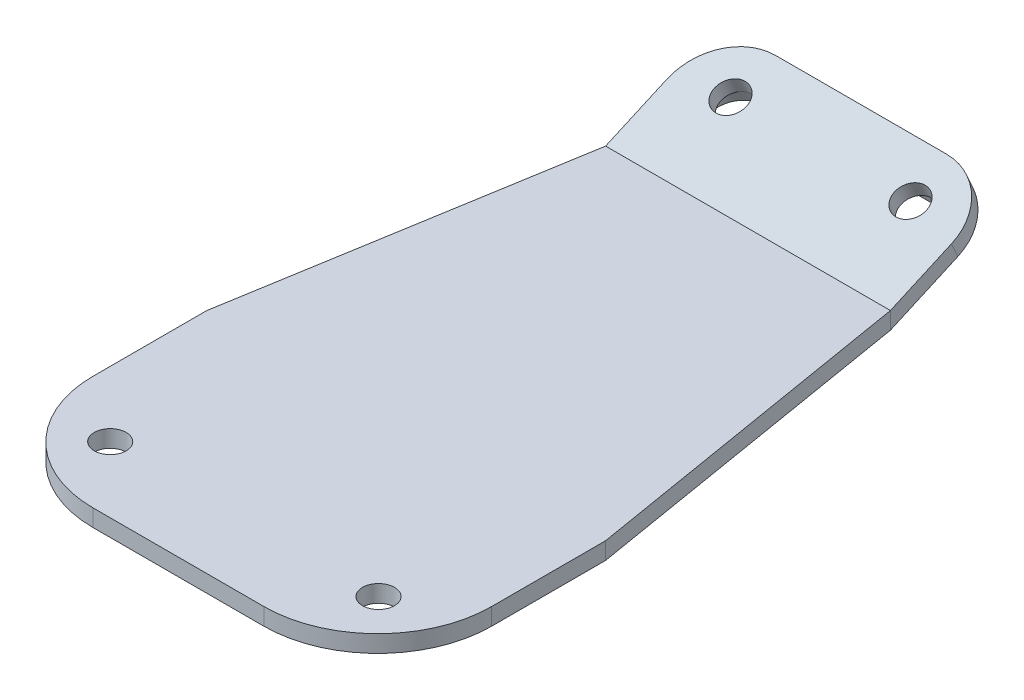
ISO-10303-21;
HEADER;
FILE_DESCRIPTION(('STEP AP214'),'2;1');
FILE_NAME('part.step','',(''),(''),'','','');
FILE_SCHEMA(('AUTOMOTIVE_DESIGN { 1 0 10303 214 1 1 1 1 }'));
ENDSEC;
DATA;
#1=APPLICATION_CONTEXT('core data for automotive mechanical design processes');
#2=APPLICATION_PROTOCOL_DEFINITION('international standard','automotive_design',2000,#1);
#3=PRODUCT_CONTEXT('',#1,'mechanical');
#4=PRODUCT('Part','Part','',(#3));
#5=PRODUCT_RELATED_PRODUCT_CATEGORY('part','',(#4));
#6=PRODUCT_DEFINITION_FORMATION('','',#4);
#7=PRODUCT_DEFINITION_CONTEXT('part definition',#1,'design');
#8=PRODUCT_DEFINITION('design','',#6,#7);
#9=PRODUCT_DEFINITION_SHAPE('','',#8);
#10=(LENGTH_UNIT() NAMED_UNIT(*) SI_UNIT(.MILLI.,.METRE.));
#11=(NAMED_UNIT(*) PLANE_ANGLE_UNIT() SI_UNIT($,.RADIAN.));
#12=(NAMED_UNIT(*) SI_UNIT($,.STERADIAN.) SOLID_ANGLE_UNIT());
#13=UNCERTAINTY_MEASURE_WITH_UNIT(LENGTH_MEASURE(1.E-05),#10,'distance_accuracy_value','');
#14=(GEOMETRIC_REPRESENTATION_CONTEXT(3) GLOBAL_UNCERTAINTY_ASSIGNED_CONTEXT((#13)) GLOBAL_UNIT_ASSIGNED_CONTEXT((#10,
#11,#12)) REPRESENTATION_CONTEXT('',''));
#15=CARTESIAN_POINT('',(0.,0.,0.));
#16=DIRECTION('',(0.,0.,1.));
#17=DIRECTION('',(1.,0.,0.));
#18=AXIS2_PLACEMENT_3D('',#15,#16,#17);
#19=CARTESIAN_POINT('',(35.,0.,-50.));
#20=DIRECTION('',(0.,0.913301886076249,0.407283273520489));
#21=DIRECTION('',(0.,-0.407283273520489,0.913301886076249));
#22=AXIS2_PLACEMENT_3D('',#19,#20,#21);
#23=PLANE('',#22);
#24=CARTESIAN_POINT('',(9.6,3.08720721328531,-56.922828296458));
#25=DIRECTION('',(0.,0.913301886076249,0.407283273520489));
#26=DIRECTION('',(0.,-0.407283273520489,0.913301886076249));
#27=AXIS2_PLACEMENT_3D('',#24,#25,#26);
#28=CIRCLE('',#27,1.4);
#29=CARTESIAN_POINT('',(9.6,2.51701063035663,-55.6442056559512));
#30=VERTEX_POINT('',#29);
#31=EDGE_CURVE('E400',#30,#30,#28,.T.);
#32=ORIENTED_EDGE('',*,*,#31,.T.);
#33=EDGE_LOOP('',(#32));
#34=FACE_BOUND('',#33,.T.);
#35=CARTESIAN_POINT('',(25.4,3.08720721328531,-56.922828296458));
#36=DIRECTION('',(0.,0.913301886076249,0.407283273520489));
#37=DIRECTION('',(0.,-0.407283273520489,0.913301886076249));
#38=AXIS2_PLACEMENT_3D('',#35,#36,#37);
#39=CIRCLE('',#38,1.4);
#40=CARTESIAN_POINT('',(25.4,2.51701063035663,-55.6442056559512));
#41=VERTEX_POINT('',#40);
#42=EDGE_CURVE('E406',#41,#41,#39,.T.);
#43=ORIENTED_EDGE('',*,*,#42,.T.);
#44=EDGE_LOOP('',(#43));
#45=FACE_BOUND('',#44,.T.);
#46=DIRECTION('',(0.,0.40728327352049,-0.913301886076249));
#47=VECTOR('',#46,1.);
#48=CARTESIAN_POINT('',(27.6,2.73490948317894,-56.1328273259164));
#49=LINE('',#48,#47);
#50=CARTESIAN_POINT('',(27.6,0.,-50.));
#51=VERTEX_POINT('',#50);
#52=CARTESIAN_POINT('',(27.6,2.63919561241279,-55.9181962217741));
#53=VERTEX_POINT('',#52);
#54=EDGE_CURVE('E304',#51,#53,#49,.T.);
#55=ORIENTED_EDGE('',*,*,#54,.F.);
#56=DIRECTION('',(-1.,0.,0.));
#57=VECTOR('',#56,1.);
#58=CARTESIAN_POINT('',(35.,0.,-50.));
#59=LINE('',#58,#57);
#60=CARTESIAN_POINT('',(7.4,0.,-50.));
#61=VERTEX_POINT('',#60);
#62=EDGE_CURVE('E316',#51,#61,#59,.T.);
#63=ORIENTED_EDGE('',*,*,#62,.T.);
#64=DIRECTION('',(0.,-0.40728327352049,0.913301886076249));
#65=VECTOR('',#64,1.);
#66=CARTESIAN_POINT('',(7.4,2.73490948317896,-56.1328273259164));
#67=LINE('',#66,#65);
#68=CARTESIAN_POINT('',(7.4,2.63919561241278,-55.9181962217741));
#69=VERTEX_POINT('',#68);
#70=EDGE_CURVE('E1090',#69,#61,#67,.T.);
#71=ORIENTED_EDGE('',*,*,#70,.F.);
#72=CARTESIAN_POINT('',(10.,2.63919561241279,-55.9181962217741));
#73=DIRECTION('',(0.,0.913301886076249,0.40728327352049));
#74=DIRECTION('',(0.,-0.40728327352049,0.913301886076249));
#75=AXIS2_PLACEMENT_3D('',#72,#73,#74);
#76=CIRCLE('',#75,2.6);
#77=CARTESIAN_POINT('',(10.,3.69813212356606,-58.2927811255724));
#78=VERTEX_POINT('',#77);
#79=EDGE_CURVE('E1101',#78,#69,#76,.T.);
#80=ORIENTED_EDGE('',*,*,#79,.F.);
#81=DIRECTION('',(-1.,0.,0.));
#82=VECTOR('',#81,1.);
#83=CARTESIAN_POINT('',(-4.01696347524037,3.69813212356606,-58.2927811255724));
#84=LINE('',#83,#82);
#85=CARTESIAN_POINT('',(25.,3.69813212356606,-58.2927811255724));
#86=VERTEX_POINT('',#85);
#87=EDGE_CURVE('E1084',#86,#78,#84,.T.);
#88=ORIENTED_EDGE('',*,*,#87,.F.);
#89=CARTESIAN_POINT('',(25.,2.63919561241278,-55.9181962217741));
#90=DIRECTION('',(0.,0.913301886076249,0.40728327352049));
#91=DIRECTION('',(0.,-0.40728327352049,0.913301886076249));
#92=AXIS2_PLACEMENT_3D('',#89,#90,#91);
#93=CIRCLE('',#92,2.6);
#94=EDGE_CURVE('E616',#53,#86,#93,.T.);
#95=ORIENTED_EDGE('',*,*,#94,.F.);
#96=EDGE_LOOP('',(#55,#63,#71,#80,#88,#95));
#97=FACE_BOUND('',#96,.T.);
#98=ADVANCED_FACE('F26',(#34,#45,#97),#23,.F.);
#99=CARTESIAN_POINT('',(35.,0.,0.));
#100=DIRECTION('',(0.,1.,0.));
#101=DIRECTION('',(0.,0.,1.));
#102=AXIS2_PLACEMENT_3D('',#99,#100,#101);
#103=PLANE('',#102);
#104=CARTESIAN_POINT('',(29.2750439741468,0.,-5.78917924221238));
#105=DIRECTION('',(0.,1.,0.));
#106=DIRECTION('',(0.,0.,1.));
#107=AXIS2_PLACEMENT_3D('',#104,#105,#106);
#108=CIRCLE('',#107,1.4);
#109=CARTESIAN_POINT('',(29.2750439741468,0.,-4.38917924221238));
#110=VERTEX_POINT('',#109);
#111=EDGE_CURVE('E418',#110,#110,#108,.T.);
#112=ORIENTED_EDGE('',*,*,#111,.T.);
#113=EDGE_LOOP('',(#112));
#114=FACE_BOUND('',#113,.T.);
#115=CARTESIAN_POINT('',(5.72495602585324,0.,-5.78917924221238));
#116=DIRECTION('',(0.,1.,0.));
#117=DIRECTION('',(0.,0.,1.));
#118=AXIS2_PLACEMENT_3D('',#115,#116,#117);
#119=CIRCLE('',#118,1.4);
#120=CARTESIAN_POINT('',(5.72495602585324,0.,-4.38917924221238));
#121=VERTEX_POINT('',#120);
#122=EDGE_CURVE('E412',#121,#121,#119,.T.);
#123=ORIENTED_EDGE('',*,*,#122,.T.);
#124=EDGE_LOOP('',(#123));
#125=FACE_BOUND('',#124,.T.);
#126=DIRECTION('',(0.986393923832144,0.,-0.164398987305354));
#127=VECTOR('',#126,1.);
#128=CARTESIAN_POINT('',(27.5888148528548,0.,-49.8684808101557));
#129=LINE('',#128,#127);
#130=CARTESIAN_POINT('',(27.5888148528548,0.,-49.8684808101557));
#131=VERTEX_POINT('',#130);
#132=CARTESIAN_POINT('',(28.3779299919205,0.,-50.));
#133=VERTEX_POINT('',#132);
#134=EDGE_CURVE('E49',#131,#133,#129,.T.);
#135=ORIENTED_EDGE('',*,*,#134,.F.);
#136=DIRECTION('',(-0.164398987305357,0.,-0.986393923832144));
#137=VECTOR('',#136,1.);
#138=CARTESIAN_POINT('',(27.5888148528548,0.,-49.8684808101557));
#139=LINE('',#138,#137);
#140=CARTESIAN_POINT('',(32.6,0.,-19.8013699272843));
#141=VERTEX_POINT('',#140);
#142=EDGE_CURVE('E666',#141,#131,#139,.T.);
#143=ORIENTED_EDGE('',*,*,#142,.F.);
#144=DIRECTION('',(0.,0.,-1.));
#145=VECTOR('',#144,1.);
#146=CARTESIAN_POINT('',(32.6,0.,-19.8013699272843));
#147=LINE('',#146,#145);
#148=CARTESIAN_POINT('',(32.6,0.,-10.));
#149=VERTEX_POINT('',#148);
#150=EDGE_CURVE('E663',#149,#141,#147,.T.);
#151=ORIENTED_EDGE('',*,*,#150,.F.);
#152=CARTESIAN_POINT('',(25.,0.,-10.));
#153=DIRECTION('',(0.,1.,0.));
#154=DIRECTION('',(0.,0.,-1.));
#155=AXIS2_PLACEMENT_3D('',#152,#153,#154);
#156=CIRCLE('',#155,7.6);
#157=CARTESIAN_POINT('',(25.,0.,-2.4));
#158=VERTEX_POINT('',#157);
#159=EDGE_CURVE('E660',#158,#149,#156,.T.);
#160=ORIENTED_EDGE('',*,*,#159,.F.);
#161=DIRECTION('',(1.,0.,0.));
#162=VECTOR('',#161,1.);
#163=CARTESIAN_POINT('',(25.,0.,-2.4));
#164=LINE('',#163,#162);
#165=CARTESIAN_POINT('',(10.,0.,-2.4));
#166=VERTEX_POINT('',#165);
#167=EDGE_CURVE('E657',#166,#158,#164,.T.);
#168=ORIENTED_EDGE('',*,*,#167,.F.);
#169=CARTESIAN_POINT('',(10.,0.,-10.));
#170=DIRECTION('',(0.,1.,0.));
#171=DIRECTION('',(0.,0.,-1.));
#172=AXIS2_PLACEMENT_3D('',#169,#170,#171);
#173=CIRCLE('',#172,7.6);
#174=CARTESIAN_POINT('',(2.4,0.,-10.));
#175=VERTEX_POINT('',#174);
#176=EDGE_CURVE('E654',#175,#166,#173,.T.);
#177=ORIENTED_EDGE('',*,*,#176,.F.);
#178=DIRECTION('',(0.,0.,1.));
#179=VECTOR('',#178,1.);
#180=CARTESIAN_POINT('',(2.4,0.,-10.));
#181=LINE('',#180,#179);
#182=CARTESIAN_POINT('',(2.4,0.,-19.8013699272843));
#183=VERTEX_POINT('',#182);
#184=EDGE_CURVE('E651',#183,#175,#181,.T.);
#185=ORIENTED_EDGE('',*,*,#184,.F.);
#186=DIRECTION('',(-0.164398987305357,0.,0.986393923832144));
#187=VECTOR('',#186,1.);
#188=CARTESIAN_POINT('',(2.4,0.,-19.8013699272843));
#189=LINE('',#188,#187);
#190=CARTESIAN_POINT('',(7.41118514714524,0.,-49.8684808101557));
#191=VERTEX_POINT('',#190);
#192=EDGE_CURVE('E348',#191,#183,#189,.T.);
#193=ORIENTED_EDGE('',*,*,#192,.F.);
#194=DIRECTION('',(0.986393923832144,0.,0.164398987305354));
#195=VECTOR('',#194,1.);
#196=CARTESIAN_POINT('',(6.62207000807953,0.,-50.));
#197=LINE('',#196,#195);
#198=CARTESIAN_POINT('',(6.62207000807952,0.,-50.));
#199=VERTEX_POINT('',#198);
#200=EDGE_CURVE('E345',#199,#191,#197,.T.);
#201=ORIENTED_EDGE('',*,*,#200,.F.);
#202=EDGE_CURVE('E329',#61,#199,#59,.T.);
#203=ORIENTED_EDGE('',*,*,#202,.F.);
#204=ORIENTED_EDGE('',*,*,#62,.F.);
#205=EDGE_CURVE('E313',#133,#51,#59,.T.);
#206=ORIENTED_EDGE('',*,*,#205,.F.);
#207=EDGE_LOOP('',(#135,#143,#151,#160,#168,#177,#185,#193,#201,#203,#204,#206));
#208=FACE_BOUND('',#207,.T.);
#209=ADVANCED_FACE('F346',(#114,#125,#208),#103,.F.);
#210=DIRECTION('',(0.164398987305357,0.,-0.986393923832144));
#211=VECTOR('',#210,1.);
#212=CARTESIAN_POINT('',(1.6,0.,-19.8675799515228));
#213=LINE('',#212,#211);
#214=CARTESIAN_POINT('',(1.6,0.,-19.8675799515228));
#215=VERTEX_POINT('',#214);
#216=EDGE_CURVE('E353',#215,#199,#213,.T.);
#217=ORIENTED_EDGE('',*,*,#216,.F.);
#218=DIRECTION('',(0.,0.,-1.));
#219=VECTOR('',#218,1.);
#220=CARTESIAN_POINT('',(1.6,0.,-10.));
#221=LINE('',#220,#219);
#222=CARTESIAN_POINT('',(1.6,0.,-10.));
#223=VERTEX_POINT('',#222);
#224=EDGE_CURVE('E368',#223,#215,#221,.T.);
#225=ORIENTED_EDGE('',*,*,#224,.F.);
#226=CARTESIAN_POINT('',(10.,0.,-10.));
#227=DIRECTION('',(0.,-1.,0.));
#228=DIRECTION('',(0.,0.,-1.));
#229=AXIS2_PLACEMENT_3D('',#226,#227,#228);
#230=CIRCLE('',#229,8.4);
#231=CARTESIAN_POINT('',(10.,0.,-1.6));
#232=VERTEX_POINT('',#231);
#233=EDGE_CURVE('E646',#232,#223,#230,.T.);
#234=ORIENTED_EDGE('',*,*,#233,.F.);
#235=DIRECTION('',(-1.,0.,0.));
#236=VECTOR('',#235,1.);
#237=CARTESIAN_POINT('',(25.,0.,-1.6));
#238=LINE('',#237,#236);
#239=CARTESIAN_POINT('',(25.,0.,-1.6));
#240=VERTEX_POINT('',#239);
#241=EDGE_CURVE('E643',#240,#232,#238,.T.);
#242=ORIENTED_EDGE('',*,*,#241,.F.);
#243=CARTESIAN_POINT('',(25.,0.,-10.));
#244=DIRECTION('',(0.,-1.,0.));
#245=DIRECTION('',(0.,0.,-1.));
#246=AXIS2_PLACEMENT_3D('',#243,#244,#245);
#247=CIRCLE('',#246,8.4);
#248=CARTESIAN_POINT('',(33.4,0.,-10.));
#249=VERTEX_POINT('',#248);
#250=EDGE_CURVE('E640',#249,#240,#247,.T.);
#251=ORIENTED_EDGE('',*,*,#250,.F.);
#252=DIRECTION('',(0.,0.,1.));
#253=VECTOR('',#252,1.);
#254=CARTESIAN_POINT('',(33.4,0.,-19.8675799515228));
#255=LINE('',#254,#253);
#256=CARTESIAN_POINT('',(33.4,0.,-19.8675799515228));
#257=VERTEX_POINT('',#256);
#258=EDGE_CURVE('E634',#257,#249,#255,.T.);
#259=ORIENTED_EDGE('',*,*,#258,.F.);
#260=DIRECTION('',(0.164398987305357,0.,0.986393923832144));
#261=VECTOR('',#260,1.);
#262=CARTESIAN_POINT('',(28.3779299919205,0.,-50.));
#263=LINE('',#262,#261);
#264=EDGE_CURVE('E312',#133,#257,#263,.T.);
#265=ORIENTED_EDGE('',*,*,#264,.F.);
#266=CARTESIAN_POINT('',(28.4,0.,-50.));
#267=VERTEX_POINT('',#266);
#268=EDGE_CURVE('E287',#267,#133,#59,.T.);
#269=ORIENTED_EDGE('',*,*,#268,.F.);
#270=CARTESIAN_POINT('',(30.,0.,-50.));
#271=VERTEX_POINT('',#270);
#272=EDGE_CURVE('E310',#271,#267,#59,.T.);
#273=ORIENTED_EDGE('',*,*,#272,.F.);
#274=DIRECTION('',(0.164398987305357,0.,0.986393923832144));
#275=VECTOR('',#274,1.);
#276=CARTESIAN_POINT('',(35.,0.,-20.));
#277=LINE('',#276,#275);
#278=CARTESIAN_POINT('',(35.,0.,-20.));
#279=VERTEX_POINT('',#278);
#280=EDGE_CURVE('E438',#271,#279,#277,.T.);
#281=ORIENTED_EDGE('',*,*,#280,.T.);
#282=DIRECTION('',(0.,0.,-1.));
#283=VECTOR('',#282,1.);
#284=CARTESIAN_POINT('',(35.,0.,0.));
#285=LINE('',#284,#283);
#286=CARTESIAN_POINT('',(35.,0.,-10.));
#287=VERTEX_POINT('',#286);
#288=EDGE_CURVE('E449',#287,#279,#285,.T.);
#289=ORIENTED_EDGE('',*,*,#288,.F.);
#290=CARTESIAN_POINT('',(25.,0.,-10.));
#291=DIRECTION('',(0.,1.,0.));
#292=DIRECTION('',(0.,0.,1.));
#293=AXIS2_PLACEMENT_3D('',#290,#291,#292);
#294=CIRCLE('',#293,10.);
#295=CARTESIAN_POINT('',(25.,0.,0.));
#296=VERTEX_POINT('',#295);
#297=EDGE_CURVE('E516',#287,#296,#294,.F.);
#298=ORIENTED_EDGE('',*,*,#297,.T.);
#299=DIRECTION('',(-1.,0.,0.));
#300=VECTOR('',#299,1.);
#301=CARTESIAN_POINT('',(35.,0.,0.));
#302=LINE('',#301,#300);
#303=CARTESIAN_POINT('',(10.,0.,0.));
#304=VERTEX_POINT('',#303);
#305=EDGE_CURVE('E322',#296,#304,#302,.T.);
#306=ORIENTED_EDGE('',*,*,#305,.T.);
#307=CARTESIAN_POINT('',(10.,0.,-10.));
#308=DIRECTION('',(0.,1.,0.));
#309=DIRECTION('',(0.,0.,1.));
#310=AXIS2_PLACEMENT_3D('',#307,#308,#309);
#311=CIRCLE('',#310,10.);
#312=CARTESIAN_POINT('',(0.,0.,-10.));
#313=VERTEX_POINT('',#312);
#314=EDGE_CURVE('E499',#304,#313,#311,.F.);
#315=ORIENTED_EDGE('',*,*,#314,.T.);
#316=DIRECTION('',(0.,0.,-1.));
#317=VECTOR('',#316,1.);
#318=CARTESIAN_POINT('',(0.,0.,0.));
#319=LINE('',#318,#317);
#320=CARTESIAN_POINT('',(0.,0.,-20.));
#321=VERTEX_POINT('',#320);
#322=EDGE_CURVE('E444',#313,#321,#319,.T.);
#323=ORIENTED_EDGE('',*,*,#322,.T.);
#324=DIRECTION('',(0.164398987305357,0.,-0.986393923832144));
#325=VECTOR('',#324,1.);
#326=CARTESIAN_POINT('',(0.,0.,-20.));
#327=LINE('',#326,#325);
#328=CARTESIAN_POINT('',(5.,0.,-50.));
#329=VERTEX_POINT('',#328);
#330=EDGE_CURVE('E430',#321,#329,#327,.T.);
#331=ORIENTED_EDGE('',*,*,#330,.T.);
#332=CARTESIAN_POINT('',(6.6,0.,-50.));
#333=VERTEX_POINT('',#332);
#334=EDGE_CURVE('E323',#333,#329,#59,.T.);
#335=ORIENTED_EDGE('',*,*,#334,.F.);
#336=EDGE_CURVE('E315',#199,#333,#59,.T.);
#337=ORIENTED_EDGE('',*,*,#336,.F.);
#338=EDGE_LOOP('',(#217,#225,#234,#242,#251,#259,#265,#269,#273,#281,#289,#298,#306,#315,#323,
#331,#335,#337));
#339=FACE_BOUND('',#338,.T.);
#340=ADVANCED_FACE('F308',(#339),#103,.F.);
#341=CARTESIAN_POINT('',(35.,1.5,0.));
#342=DIRECTION('',(0.,-1.,0.));
#343=DIRECTION('',(0.,0.,-1.));
#344=AXIS2_PLACEMENT_3D('',#341,#342,#343);
#345=PLANE('',#344);
#346=CARTESIAN_POINT('',(5.72495602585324,1.5,-5.78917924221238));
#347=DIRECTION('',(0.,1.,0.));
#348=DIRECTION('',(0.,0.,1.));
#349=AXIS2_PLACEMENT_3D('',#346,#347,#348);
#350=CIRCLE('',#349,1.4);
#351=CARTESIAN_POINT('',(5.72495602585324,1.5,-4.38917924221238));
#352=VERTEX_POINT('',#351);
#353=EDGE_CURVE('E409',#352,#352,#350,.T.);
#354=ORIENTED_EDGE('',*,*,#353,.F.);
#355=EDGE_LOOP('',(#354));
#356=FACE_BOUND('',#355,.T.);
#357=CARTESIAN_POINT('',(29.2750439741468,1.5,-5.78917924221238));
#358=DIRECTION('',(0.,1.,0.));
#359=DIRECTION('',(0.,0.,1.));
#360=AXIS2_PLACEMENT_3D('',#357,#358,#359);
#361=CIRCLE('',#360,1.4);
#362=CARTESIAN_POINT('',(29.2750439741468,1.5,-4.38917924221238));
#363=VERTEX_POINT('',#362);
#364=EDGE_CURVE('E415',#363,#363,#361,.T.);
#365=ORIENTED_EDGE('',*,*,#364,.F.);
#366=EDGE_LOOP('',(#365));
#367=FACE_BOUND('',#366,.T.);
#368=DIRECTION('',(0.164398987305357,0.,-0.986393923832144));
#369=VECTOR('',#368,1.);
#370=CARTESIAN_POINT('',(-2.2972972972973,1.5,-6.21621621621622));
#371=LINE('',#370,#369);
#372=CARTESIAN_POINT('',(0.,1.5,-20.));
#373=VERTEX_POINT('',#372);
#374=CARTESIAN_POINT('',(5.,1.5,-50.));
#375=VERTEX_POINT('',#374);
#376=EDGE_CURVE('E435',#373,#375,#371,.T.);
#377=ORIENTED_EDGE('',*,*,#376,.F.);
#378=DIRECTION('',(0.,0.,1.));
#379=VECTOR('',#378,1.);
#380=CARTESIAN_POINT('',(0.,1.5,0.));
#381=LINE('',#380,#379);
#382=CARTESIAN_POINT('',(0.,1.5,-10.));
#383=VERTEX_POINT('',#382);
#384=EDGE_CURVE('E447',#373,#383,#381,.T.);
#385=ORIENTED_EDGE('',*,*,#384,.T.);
#386=CARTESIAN_POINT('',(10.,1.5,-10.));
#387=DIRECTION('',(0.,-1.,0.));
#388=DIRECTION('',(0.,0.,-1.));
#389=AXIS2_PLACEMENT_3D('',#386,#387,#388);
#390=CIRCLE('',#389,10.);
#391=CARTESIAN_POINT('',(10.,1.5,0.));
#392=VERTEX_POINT('',#391);
#393=EDGE_CURVE('E511',#383,#392,#390,.F.);
#394=ORIENTED_EDGE('',*,*,#393,.T.);
#395=DIRECTION('',(-1.,0.,0.));
#396=VECTOR('',#395,1.);
#397=CARTESIAN_POINT('',(35.,1.5,0.));
#398=LINE('',#397,#396);
#399=CARTESIAN_POINT('',(25.,1.5,0.));
#400=VERTEX_POINT('',#399);
#401=EDGE_CURVE('E454',#400,#392,#398,.T.);
#402=ORIENTED_EDGE('',*,*,#401,.F.);
#403=CARTESIAN_POINT('',(25.,1.5,-10.));
#404=DIRECTION('',(0.,-1.,0.));
#405=DIRECTION('',(0.,0.,-1.));
#406=AXIS2_PLACEMENT_3D('',#403,#404,#405);
#407=CIRCLE('',#406,10.);
#408=CARTESIAN_POINT('',(35.,1.5,-10.));
#409=VERTEX_POINT('',#408);
#410=EDGE_CURVE('E512',#400,#409,#407,.F.);
#411=ORIENTED_EDGE('',*,*,#410,.T.);
#412=DIRECTION('',(0.,0.,1.));
#413=VECTOR('',#412,1.);
#414=CARTESIAN_POINT('',(35.,1.5,0.));
#415=LINE('',#414,#413);
#416=CARTESIAN_POINT('',(35.,1.5,-20.));
#417=VERTEX_POINT('',#416);
#418=EDGE_CURVE('E452',#417,#409,#415,.T.);
#419=ORIENTED_EDGE('',*,*,#418,.F.);
#420=DIRECTION('',(0.164398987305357,0.,0.986393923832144));
#421=VECTOR('',#420,1.);
#422=CARTESIAN_POINT('',(38.2432432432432,1.5,-0.540540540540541));
#423=LINE('',#422,#421);
#424=CARTESIAN_POINT('',(30.,1.5,-50.));
#425=VERTEX_POINT('',#424);
#426=EDGE_CURVE('E442',#425,#417,#423,.T.);
#427=ORIENTED_EDGE('',*,*,#426,.F.);
#428=DIRECTION('',(-1.,0.,0.));
#429=VECTOR('',#428,1.);
#430=CARTESIAN_POINT('',(35.,1.5,-50.));
#431=LINE('',#430,#429);
#432=EDGE_CURVE('E457',#425,#375,#431,.T.);
#433=ORIENTED_EDGE('',*,*,#432,.T.);
#434=EDGE_LOOP('',(#377,#385,#394,#402,#411,#419,#427,#433));
#435=FACE_BOUND('',#434,.T.);
#436=ADVANCED_FACE('F546',(#356,#367,#435),#345,.F.);
#437=CARTESIAN_POINT('',(0.,1.5,0.));
#438=DIRECTION('',(-1.,0.,0.));
#439=DIRECTION('',(0.,0.,1.));
#440=AXIS2_PLACEMENT_3D('',#437,#438,#439);
#441=PLANE('',#440);
#442=ORIENTED_EDGE('',*,*,#384,.F.);
#443=DIRECTION('',(0.,-1.,0.));
#444=VECTOR('',#443,1.);
#445=CARTESIAN_POINT('',(0.,1.5,-20.));
#446=LINE('',#445,#444);
#447=EDGE_CURVE('E481',#373,#321,#446,.T.);
#448=ORIENTED_EDGE('',*,*,#447,.T.);
#449=ORIENTED_EDGE('',*,*,#322,.F.);
#450=DIRECTION('',(0.,-1.,0.));
#451=VECTOR('',#450,1.);
#452=CARTESIAN_POINT('',(0.,1.5,-10.));
#453=LINE('',#452,#451);
#454=EDGE_CURVE('E505',#313,#383,#453,.F.);
#455=ORIENTED_EDGE('',*,*,#454,.T.);
#456=EDGE_LOOP('',(#442,#448,#449,#455));
#457=FACE_BOUND('',#456,.T.);
#458=ADVANCED_FACE('F504',(#457),#441,.T.);
#459=CARTESIAN_POINT('',(35.,1.5,0.));
#460=DIRECTION('',(-1.,0.,0.));
#461=DIRECTION('',(0.,0.,1.));
#462=AXIS2_PLACEMENT_3D('',#459,#460,#461);
#463=PLANE('',#462);
#464=DIRECTION('',(0.,-1.,0.));
#465=VECTOR('',#464,1.);
#466=CARTESIAN_POINT('',(35.,1.5,-20.));
#467=LINE('',#466,#465);
#468=EDGE_CURVE('E524',#417,#279,#467,.T.);
#469=ORIENTED_EDGE('',*,*,#468,.F.);
#470=ORIENTED_EDGE('',*,*,#418,.T.);
#471=DIRECTION('',(0.,-1.,0.));
#472=VECTOR('',#471,1.);
#473=CARTESIAN_POINT('',(35.,1.5,-10.));
#474=LINE('',#473,#472);
#475=EDGE_CURVE('E521',#409,#287,#474,.T.);
#476=ORIENTED_EDGE('',*,*,#475,.T.);
#477=ORIENTED_EDGE('',*,*,#288,.T.);
#478=EDGE_LOOP('',(#469,#470,#476,#477));
#479=FACE_BOUND('',#478,.T.);
#480=ADVANCED_FACE('F533',(#479),#463,.F.);
#481=CARTESIAN_POINT('',(35.,0.,0.));
#482=DIRECTION('',(0.,0.,-1.));
#483=DIRECTION('',(-1.,0.,0.));
#484=AXIS2_PLACEMENT_3D('',#481,#482,#483);
#485=PLANE('',#484);
#486=ORIENTED_EDGE('',*,*,#401,.T.);
#487=DIRECTION('',(0.,-1.,0.));
#488=VECTOR('',#487,1.);
#489=CARTESIAN_POINT('',(10.,0.,0.));
#490=LINE('',#489,#488);
#491=EDGE_CURVE('E540',#392,#304,#490,.T.);
#492=ORIENTED_EDGE('',*,*,#491,.T.);
#493=ORIENTED_EDGE('',*,*,#305,.F.);
#494=DIRECTION('',(0.,-1.,0.));
#495=VECTOR('',#494,1.);
#496=CARTESIAN_POINT('',(25.,0.,0.));
#497=LINE('',#496,#495);
#498=EDGE_CURVE('E325',#296,#400,#497,.F.);
#499=ORIENTED_EDGE('',*,*,#498,.T.);
#500=EDGE_LOOP('',(#486,#492,#493,#499));
#501=FACE_BOUND('',#500,.T.);
#502=ADVANCED_FACE('F28',(#501),#485,.F.);
#503=ORIENTED_EDGE('',*,*,#272,.T.);
#504=DIRECTION('',(0.,0.40728327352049,-0.913301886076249));
#505=VECTOR('',#504,1.);
#506=CARTESIAN_POINT('',(28.4,2.73490948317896,-56.1328273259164));
#507=LINE('',#506,#505);
#508=CARTESIAN_POINT('',(28.4,2.63919561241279,-55.9181962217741));
#509=VERTEX_POINT('',#508);
#510=EDGE_CURVE('E297',#267,#509,#507,.T.);
#511=ORIENTED_EDGE('',*,*,#510,.T.);
#512=CARTESIAN_POINT('',(25.,2.63919561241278,-55.9181962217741));
#513=DIRECTION('',(0.,0.913301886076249,0.40728327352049));
#514=DIRECTION('',(0.,-0.40728327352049,0.913301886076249));
#515=AXIS2_PLACEMENT_3D('',#512,#513,#514);
#516=CIRCLE('',#515,3.40000000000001);
#517=CARTESIAN_POINT('',(25.,4.02395874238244,-59.0234226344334));
#518=VERTEX_POINT('',#517);
#519=EDGE_CURVE('E1030',#509,#518,#516,.T.);
#520=ORIENTED_EDGE('',*,*,#519,.T.);
#521=DIRECTION('',(-1.,0.,0.));
#522=VECTOR('',#521,1.);
#523=CARTESIAN_POINT('',(-4.01696347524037,4.02395874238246,-59.0234226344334));
#524=LINE('',#523,#522);
#525=CARTESIAN_POINT('',(10.,4.02395874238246,-59.0234226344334));
#526=VERTEX_POINT('',#525);
#527=EDGE_CURVE('E41',#518,#526,#524,.T.);
#528=ORIENTED_EDGE('',*,*,#527,.T.);
#529=CARTESIAN_POINT('',(10.,2.63919561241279,-55.9181962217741));
#530=DIRECTION('',(0.,0.913301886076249,0.40728327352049));
#531=DIRECTION('',(0.,-0.40728327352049,0.913301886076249));
#532=AXIS2_PLACEMENT_3D('',#529,#530,#531);
#533=CIRCLE('',#532,3.40000000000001);
#534=CARTESIAN_POINT('',(6.6,2.63919561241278,-55.9181962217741));
#535=VERTEX_POINT('',#534);
#536=EDGE_CURVE('E1096',#526,#535,#533,.T.);
#537=ORIENTED_EDGE('',*,*,#536,.T.);
#538=DIRECTION('',(0.,-0.40728327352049,0.913301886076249));
#539=VECTOR('',#538,1.);
#540=CARTESIAN_POINT('',(6.6,2.73490948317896,-56.1328273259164));
#541=LINE('',#540,#539);
#542=EDGE_CURVE('E1092',#535,#333,#541,.T.);
#543=ORIENTED_EDGE('',*,*,#542,.T.);
#544=ORIENTED_EDGE('',*,*,#334,.T.);
#545=DIRECTION('',(0.,-0.40728327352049,0.913301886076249));
#546=VECTOR('',#545,1.);
#547=CARTESIAN_POINT('',(5.,0.,-50.));
#548=LINE('',#547,#546);
#549=CARTESIAN_POINT('',(5.,2.63919561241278,-55.9181962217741));
#550=VERTEX_POINT('',#549);
#551=EDGE_CURVE('E421',#550,#329,#548,.T.);
#552=ORIENTED_EDGE('',*,*,#551,.F.);
#553=CARTESIAN_POINT('',(10.,2.63919561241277,-55.9181962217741));
#554=DIRECTION('',(0.,0.913301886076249,0.407283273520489));
#555=DIRECTION('',(0.,-0.407283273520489,0.913301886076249));
#556=AXIS2_PLACEMENT_3D('',#553,#554,#555);
#557=CIRCLE('',#556,5.);
#558=CARTESIAN_POINT('',(10.,4.67561198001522,-60.4847056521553));
#559=VERTEX_POINT('',#558);
#560=EDGE_CURVE('E34',#550,#559,#557,.F.);
#561=ORIENTED_EDGE('',*,*,#560,.T.);
#562=DIRECTION('',(-1.,0.,0.));
#563=VECTOR('',#562,1.);
#564=CARTESIAN_POINT('',(35.,4.67561198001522,-60.4847056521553));
#565=LINE('',#564,#563);
#566=CARTESIAN_POINT('',(25.,4.67561198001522,-60.4847056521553));
#567=VERTEX_POINT('',#566);
#568=EDGE_CURVE('E328',#567,#559,#565,.T.);
#569=ORIENTED_EDGE('',*,*,#568,.F.);
#570=CARTESIAN_POINT('',(25.,2.63919561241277,-55.9181962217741));
#571=DIRECTION('',(0.,0.913301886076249,0.407283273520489));
#572=DIRECTION('',(0.,-0.407283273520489,0.913301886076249));
#573=AXIS2_PLACEMENT_3D('',#570,#571,#572);
#574=CIRCLE('',#573,5.);
#575=CARTESIAN_POINT('',(30.,2.63919561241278,-55.9181962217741));
#576=VERTEX_POINT('',#575);
#577=EDGE_CURVE('E488',#567,#576,#574,.F.);
#578=ORIENTED_EDGE('',*,*,#577,.T.);
#579=DIRECTION('',(0.,0.40728327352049,-0.913301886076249));
#580=VECTOR('',#579,1.);
#581=CARTESIAN_POINT('',(30.,0.,-50.));
#582=LINE('',#581,#580);
#583=EDGE_CURVE('E320',#271,#576,#582,.T.);
#584=ORIENTED_EDGE('',*,*,#583,.F.);
#585=EDGE_LOOP('',(#503,#511,#520,#528,#537,#543,#544,#552,#561,#569,#578,#584));
#586=FACE_BOUND('',#585,.T.);
#587=ADVANCED_FACE('F318',(#586),#23,.F.);
#588=CARTESIAN_POINT('',(35.,4.67561198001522,-60.4847056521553));
#589=DIRECTION('',(0.,-0.407283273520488,0.91330188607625));
#590=DIRECTION('',(0.,-0.91330188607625,-0.407283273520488));
#591=AXIS2_PLACEMENT_3D('',#588,#589,#590);
#592=PLANE('',#591);
#593=ORIENTED_EDGE('',*,*,#568,.T.);
#594=DIRECTION('',(0.,0.91330188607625,0.407283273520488));
#595=VECTOR('',#594,1.);
#596=CARTESIAN_POINT('',(10.,4.67561198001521,-60.4847056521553));
#597=LINE('',#596,#595);
#598=CARTESIAN_POINT('',(10.,5.92679248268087,-59.926746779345));
#599=VERTEX_POINT('',#598);
#600=EDGE_CURVE('E470',#559,#599,#597,.T.);
#601=ORIENTED_EDGE('',*,*,#600,.T.);
#602=DIRECTION('',(-1.,0.,0.));
#603=VECTOR('',#602,1.);
#604=CARTESIAN_POINT('',(35.,5.92679248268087,-59.926746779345));
#605=LINE('',#604,#603);
#606=CARTESIAN_POINT('',(25.,5.92679248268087,-59.926746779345));
#607=VERTEX_POINT('',#606);
#608=EDGE_CURVE('E460',#607,#599,#605,.T.);
#609=ORIENTED_EDGE('',*,*,#608,.F.);
#610=DIRECTION('',(0.,-0.91330188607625,-0.407283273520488));
#611=VECTOR('',#610,1.);
#612=CARTESIAN_POINT('',(25.,4.67561198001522,-60.4847056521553));
#613=LINE('',#612,#611);
#614=EDGE_CURVE('E472',#607,#567,#613,.T.);
#615=ORIENTED_EDGE('',*,*,#614,.T.);
#616=EDGE_LOOP('',(#593,#601,#609,#615));
#617=FACE_BOUND('',#616,.T.);
#618=ADVANCED_FACE('F468',(#617),#592,.F.);
#619=CARTESIAN_POINT('',(35.,5.92679248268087,-59.926746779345));
#620=DIRECTION('',(0.,-0.913301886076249,-0.407283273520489));
#621=DIRECTION('',(0.,0.407283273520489,-0.913301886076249));
#622=AXIS2_PLACEMENT_3D('',#619,#620,#621);
#623=PLANE('',#622);
#624=CARTESIAN_POINT('',(9.6,4.33838771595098,-56.3648694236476));
#625=DIRECTION('',(0.,0.913301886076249,0.40728327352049));
#626=DIRECTION('',(0.,-0.40728327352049,0.913301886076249));
#627=AXIS2_PLACEMENT_3D('',#624,#625,#626);
#628=CIRCLE('',#627,1.4);
#629=CARTESIAN_POINT('',(9.6,3.7681911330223,-55.0862467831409));
#630=VERTEX_POINT('',#629);
#631=EDGE_CURVE('E397',#630,#630,#628,.T.);
#632=ORIENTED_EDGE('',*,*,#631,.F.);
#633=EDGE_LOOP('',(#632));
#634=FACE_BOUND('',#633,.T.);
#635=CARTESIAN_POINT('',(25.4,4.33838771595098,-56.3648694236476));
#636=DIRECTION('',(0.,0.913301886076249,0.40728327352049));
#637=DIRECTION('',(0.,0.40728327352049,-0.913301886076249));
#638=AXIS2_PLACEMENT_3D('',#635,#636,#637);
#639=CIRCLE('',#638,1.4);
#640=CARTESIAN_POINT('',(25.4,4.90858429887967,-57.6434920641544));
#641=VERTEX_POINT('',#640);
#642=EDGE_CURVE('E403',#641,#641,#639,.T.);
#643=ORIENTED_EDGE('',*,*,#642,.F.);
#644=EDGE_LOOP('',(#643));
#645=FACE_BOUND('',#644,.T.);
#646=ORIENTED_EDGE('',*,*,#608,.T.);
#647=CARTESIAN_POINT('',(10.,3.89037611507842,-55.3602373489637));
#648=DIRECTION('',(0.,-0.913301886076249,-0.407283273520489));
#649=DIRECTION('',(0.,0.407283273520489,-0.913301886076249));
#650=AXIS2_PLACEMENT_3D('',#647,#648,#649);
#651=CIRCLE('',#650,5.);
#652=CARTESIAN_POINT('',(5.,3.89037611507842,-55.3602373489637));
#653=VERTEX_POINT('',#652);
#654=EDGE_CURVE('E477',#599,#653,#651,.F.);
#655=ORIENTED_EDGE('',*,*,#654,.T.);
#656=DIRECTION('',(0.,-0.407283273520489,0.913301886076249));
#657=VECTOR('',#656,1.);
#658=CARTESIAN_POINT('',(5.,5.92679248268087,-59.926746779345));
#659=LINE('',#658,#657);
#660=EDGE_CURVE('E424',#653,#375,#659,.T.);
#661=ORIENTED_EDGE('',*,*,#660,.T.);
#662=ORIENTED_EDGE('',*,*,#432,.F.);
#663=DIRECTION('',(0.,0.407283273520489,-0.913301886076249));
#664=VECTOR('',#663,1.);
#665=CARTESIAN_POINT('',(30.,5.92679248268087,-59.926746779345));
#666=LINE('',#665,#664);
#667=CARTESIAN_POINT('',(30.,3.89037611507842,-55.3602373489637));
#668=VERTEX_POINT('',#667);
#669=EDGE_CURVE('E427',#425,#668,#666,.T.);
#670=ORIENTED_EDGE('',*,*,#669,.T.);
#671=CARTESIAN_POINT('',(25.,3.89037611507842,-55.3602373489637));
#672=DIRECTION('',(0.,-0.913301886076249,-0.407283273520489));
#673=DIRECTION('',(0.,0.407283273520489,-0.913301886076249));
#674=AXIS2_PLACEMENT_3D('',#671,#672,#673);
#675=CIRCLE('',#674,5.);
#676=EDGE_CURVE('E478',#668,#607,#675,.F.);
#677=ORIENTED_EDGE('',*,*,#676,.T.);
#678=EDGE_LOOP('',(#646,#655,#661,#662,#670,#677));
#679=FACE_BOUND('',#678,.T.);
#680=ADVANCED_FACE('F549',(#634,#645,#679),#623,.F.);
#681=CARTESIAN_POINT('',(10.,0.,-10.));
#682=DIRECTION('',(0.,1.,0.));
#683=DIRECTION('',(0.,0.,1.));
#684=AXIS2_PLACEMENT_3D('',#681,#682,#683);
#685=CYLINDRICAL_SURFACE('',#684,10.);
#686=ORIENTED_EDGE('',*,*,#393,.F.);
#687=ORIENTED_EDGE('',*,*,#454,.F.);
#688=ORIENTED_EDGE('',*,*,#314,.F.);
#689=ORIENTED_EDGE('',*,*,#491,.F.);
#690=EDGE_LOOP('',(#686,#687,#688,#689));
#691=FACE_BOUND('',#690,.T.);
#692=ADVANCED_FACE('F508',(#691),#685,.T.);
#693=CARTESIAN_POINT('',(25.,1.5,-10.));
#694=DIRECTION('',(0.,-1.,0.));
#695=DIRECTION('',(0.,0.,-1.));
#696=AXIS2_PLACEMENT_3D('',#693,#694,#695);
#697=CYLINDRICAL_SURFACE('',#696,10.);
#698=ORIENTED_EDGE('',*,*,#410,.F.);
#699=ORIENTED_EDGE('',*,*,#498,.F.);
#700=ORIENTED_EDGE('',*,*,#297,.F.);
#701=ORIENTED_EDGE('',*,*,#475,.F.);
#702=EDGE_LOOP('',(#698,#699,#700,#701));
#703=FACE_BOUND('',#702,.T.);
#704=ADVANCED_FACE('F537',(#703),#697,.T.);
#705=CARTESIAN_POINT('',(35.,30.,-20.));
#706=DIRECTION('',(0.986393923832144,0.,-0.164398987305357));
#707=DIRECTION('',(-0.164398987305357,0.,-0.986393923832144));
#708=AXIS2_PLACEMENT_3D('',#705,#706,#707);
#709=PLANE('',#708);
#710=ORIENTED_EDGE('',*,*,#426,.T.);
#711=ORIENTED_EDGE('',*,*,#468,.T.);
#712=ORIENTED_EDGE('',*,*,#280,.F.);
#713=DIRECTION('',(0.,-1.,0.));
#714=VECTOR('',#713,1.);
#715=CARTESIAN_POINT('',(30.,30.,-50.));
#716=LINE('',#715,#714);
#717=EDGE_CURVE('E440',#425,#271,#716,.T.);
#718=ORIENTED_EDGE('',*,*,#717,.F.);
#719=EDGE_LOOP('',(#710,#711,#712,#718));
#720=FACE_BOUND('',#719,.T.);
#721=ADVANCED_FACE('F527',(#720),#709,.T.);
#722=CARTESIAN_POINT('',(0.,30.,-20.));
#723=DIRECTION('',(-0.986393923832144,0.,-0.164398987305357));
#724=DIRECTION('',(-0.164398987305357,0.,0.986393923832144));
#725=AXIS2_PLACEMENT_3D('',#722,#723,#724);
#726=PLANE('',#725);
#727=ORIENTED_EDGE('',*,*,#376,.T.);
#728=DIRECTION('',(0.,-1.,0.));
#729=VECTOR('',#728,1.);
#730=CARTESIAN_POINT('',(5.,30.,-50.));
#731=LINE('',#730,#729);
#732=EDGE_CURVE('E432',#375,#329,#731,.T.);
#733=ORIENTED_EDGE('',*,*,#732,.T.);
#734=ORIENTED_EDGE('',*,*,#330,.F.);
#735=ORIENTED_EDGE('',*,*,#447,.F.);
#736=EDGE_LOOP('',(#727,#733,#734,#735));
#737=FACE_BOUND('',#736,.T.);
#738=ADVANCED_FACE('F495',(#737),#726,.T.);
#739=CARTESIAN_POINT('',(30.,20.,-50.));
#740=DIRECTION('',(-1.,0.,0.));
#741=DIRECTION('',(0.,0.,1.));
#742=AXIS2_PLACEMENT_3D('',#739,#740,#741);
#743=PLANE('',#742);
#744=ORIENTED_EDGE('',*,*,#583,.T.);
#745=DIRECTION('',(0.,-0.91330188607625,-0.407283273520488));
#746=VECTOR('',#745,1.);
#747=CARTESIAN_POINT('',(30.,19.3216023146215,-48.4787445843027));
#748=LINE('',#747,#746);
#749=EDGE_CURVE('E11',#576,#668,#748,.F.);
#750=ORIENTED_EDGE('',*,*,#749,.T.);
#751=ORIENTED_EDGE('',*,*,#669,.F.);
#752=ORIENTED_EDGE('',*,*,#717,.T.);
#753=EDGE_LOOP('',(#744,#750,#751,#752));
#754=FACE_BOUND('',#753,.T.);
#755=ADVANCED_FACE('F555',(#754),#743,.F.);
#756=CARTESIAN_POINT('',(5.,20.,-50.));
#757=DIRECTION('',(1.,0.,0.));
#758=DIRECTION('',(0.,0.,-1.));
#759=AXIS2_PLACEMENT_3D('',#756,#757,#758);
#760=PLANE('',#759);
#761=ORIENTED_EDGE('',*,*,#660,.F.);
#762=DIRECTION('',(0.,0.91330188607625,0.407283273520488));
#763=VECTOR('',#762,1.);
#764=CARTESIAN_POINT('',(5.,19.3216023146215,-48.4787445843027));
#765=LINE('',#764,#763);
#766=EDGE_CURVE('E486',#653,#550,#765,.F.);
#767=ORIENTED_EDGE('',*,*,#766,.T.);
#768=ORIENTED_EDGE('',*,*,#551,.T.);
#769=ORIENTED_EDGE('',*,*,#732,.F.);
#770=EDGE_LOOP('',(#761,#767,#768,#769));
#771=FACE_BOUND('',#770,.T.);
#772=ADVANCED_FACE('F493',(#771),#760,.F.);
#773=CARTESIAN_POINT('',(10.,2.63919561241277,-55.9181962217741));
#774=DIRECTION('',(0.,0.91330188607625,0.407283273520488));
#775=DIRECTION('',(0.,-0.407283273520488,0.91330188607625));
#776=AXIS2_PLACEMENT_3D('',#773,#774,#775);
#777=CYLINDRICAL_SURFACE('',#776,5.);
#778=ORIENTED_EDGE('',*,*,#560,.F.);
#779=ORIENTED_EDGE('',*,*,#766,.F.);
#780=ORIENTED_EDGE('',*,*,#654,.F.);
#781=ORIENTED_EDGE('',*,*,#600,.F.);
#782=EDGE_LOOP('',(#778,#779,#780,#781));
#783=FACE_BOUND('',#782,.T.);
#784=ADVANCED_FACE('F475',(#783),#777,.T.);
#785=CARTESIAN_POINT('',(25.,2.63919561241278,-55.9181962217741));
#786=DIRECTION('',(0.,-0.91330188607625,-0.407283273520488));
#787=DIRECTION('',(0.,0.407283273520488,-0.91330188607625));
#788=AXIS2_PLACEMENT_3D('',#785,#786,#787);
#789=CYLINDRICAL_SURFACE('',#788,5.);
#790=ORIENTED_EDGE('',*,*,#676,.F.);
#791=ORIENTED_EDGE('',*,*,#749,.F.);
#792=ORIENTED_EDGE('',*,*,#577,.F.);
#793=ORIENTED_EDGE('',*,*,#614,.F.);
#794=EDGE_LOOP('',(#790,#791,#792,#793));
#795=FACE_BOUND('',#794,.T.);
#796=ADVANCED_FACE('F552',(#795),#789,.T.);
#797=CARTESIAN_POINT('',(29.2750439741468,-6.5,-5.78917924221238));
#798=DIRECTION('',(0.,1.,0.));
#799=DIRECTION('',(0.,0.,1.));
#800=AXIS2_PLACEMENT_3D('',#797,#798,#799);
#801=CYLINDRICAL_SURFACE('',#800,1.4);
#802=ORIENTED_EDGE('',*,*,#364,.T.);
#803=EDGE_LOOP('',(#802));
#804=FACE_BOUND('',#803,.T.);
#805=ORIENTED_EDGE('',*,*,#111,.F.);
#806=EDGE_LOOP('',(#805));
#807=FACE_BOUND('',#806,.T.);
#808=ADVANCED_FACE('F795',(#804,#807),#801,.F.);
#809=CARTESIAN_POINT('',(5.72495602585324,-6.5,-5.78917924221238));
#810=DIRECTION('',(0.,1.,0.));
#811=DIRECTION('',(0.,0.,1.));
#812=AXIS2_PLACEMENT_3D('',#809,#810,#811);
#813=CYLINDRICAL_SURFACE('',#812,1.4);
#814=ORIENTED_EDGE('',*,*,#353,.T.);
#815=EDGE_LOOP('',(#814));
#816=FACE_BOUND('',#815,.T.);
#817=ORIENTED_EDGE('',*,*,#122,.F.);
#818=EDGE_LOOP('',(#817));
#819=FACE_BOUND('',#818,.T.);
#820=ADVANCED_FACE('F609',(#816,#819),#813,.F.);
#821=CARTESIAN_POINT('',(25.4,-2.96802737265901,-59.6231356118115));
#822=DIRECTION('',(0.,0.913301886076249,0.40728327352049));
#823=DIRECTION('',(0.,-0.40728327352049,0.913301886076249));
#824=AXIS2_PLACEMENT_3D('',#821,#822,#823);
#825=CYLINDRICAL_SURFACE('',#824,1.4);
#826=ORIENTED_EDGE('',*,*,#642,.T.);
#827=EDGE_LOOP('',(#826));
#828=FACE_BOUND('',#827,.T.);
#829=ORIENTED_EDGE('',*,*,#42,.F.);
#830=EDGE_LOOP('',(#829));
#831=FACE_BOUND('',#830,.T.);
#832=ADVANCED_FACE('F606',(#828,#831),#825,.F.);
#833=CARTESIAN_POINT('',(9.6,-2.96802737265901,-59.6231356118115));
#834=DIRECTION('',(0.,0.913301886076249,0.40728327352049));
#835=DIRECTION('',(0.,-0.40728327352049,0.913301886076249));
#836=AXIS2_PLACEMENT_3D('',#833,#834,#835);
#837=CYLINDRICAL_SURFACE('',#836,1.4);
#838=ORIENTED_EDGE('',*,*,#631,.T.);
#839=EDGE_LOOP('',(#838));
#840=FACE_BOUND('',#839,.T.);
#841=ORIENTED_EDGE('',*,*,#31,.F.);
#842=EDGE_LOOP('',(#841));
#843=FACE_BOUND('',#842,.T.);
#844=ADVANCED_FACE('F608',(#840,#843),#837,.F.);
#845=CARTESIAN_POINT('',(27.5888148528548,-1.,-49.8684808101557));
#846=DIRECTION('',(0.164398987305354,0.,0.986393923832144));
#847=DIRECTION('',(0.986393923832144,0.,-0.164398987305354));
#848=AXIS2_PLACEMENT_3D('',#845,#846,#847);
#849=PLANE('',#848);
#850=ORIENTED_EDGE('',*,*,#134,.T.);
#851=DIRECTION('',(0.,1.,0.));
#852=VECTOR('',#851,1.);
#853=CARTESIAN_POINT('',(28.3779299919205,-1.,-50.));
#854=LINE('',#853,#852);
#855=CARTESIAN_POINT('',(28.3779299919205,-1.,-50.));
#856=VERTEX_POINT('',#855);
#857=EDGE_CURVE('E394',#856,#133,#854,.T.);
#858=ORIENTED_EDGE('',*,*,#857,.F.);
#859=DIRECTION('',(0.986393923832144,0.,-0.164398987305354));
#860=VECTOR('',#859,1.);
#861=CARTESIAN_POINT('',(27.5888148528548,-1.,-49.8684808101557));
#862=LINE('',#861,#860);
#863=CARTESIAN_POINT('',(27.5888148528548,-1.,-49.8684808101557));
#864=VERTEX_POINT('',#863);
#865=EDGE_CURVE('E668',#864,#856,#862,.T.);
#866=ORIENTED_EDGE('',*,*,#865,.F.);
#867=DIRECTION('',(0.,1.,0.));
#868=VECTOR('',#867,1.);
#869=CARTESIAN_POINT('',(27.5888148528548,-1.,-49.8684808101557));
#870=LINE('',#869,#868);
#871=EDGE_CURVE('E632',#864,#131,#870,.T.);
#872=ORIENTED_EDGE('',*,*,#871,.T.);
#873=EDGE_LOOP('',(#850,#858,#866,#872));
#874=FACE_BOUND('',#873,.T.);
#875=ADVANCED_FACE('F630',(#874),#849,.F.);
#876=CARTESIAN_POINT('',(28.3779299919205,-1.,-50.));
#877=DIRECTION('',(-0.986393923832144,0.,0.164398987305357));
#878=DIRECTION('',(0.164398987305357,0.,0.986393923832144));
#879=AXIS2_PLACEMENT_3D('',#876,#877,#878);
#880=PLANE('',#879);
#881=ORIENTED_EDGE('',*,*,#264,.T.);
#882=DIRECTION('',(0.,1.,0.));
#883=VECTOR('',#882,1.);
#884=CARTESIAN_POINT('',(33.4,-1.,-19.8675799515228));
#885=LINE('',#884,#883);
#886=CARTESIAN_POINT('',(33.4,-1.,-19.8675799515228));
#887=VERTEX_POINT('',#886);
#888=EDGE_CURVE('E391',#887,#257,#885,.T.);
#889=ORIENTED_EDGE('',*,*,#888,.F.);
#890=DIRECTION('',(0.164398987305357,0.,0.986393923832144));
#891=VECTOR('',#890,1.);
#892=CARTESIAN_POINT('',(28.3779299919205,-1.,-50.));
#893=LINE('',#892,#891);
#894=EDGE_CURVE('E625',#856,#887,#893,.T.);
#895=ORIENTED_EDGE('',*,*,#894,.F.);
#896=ORIENTED_EDGE('',*,*,#857,.T.);
#897=EDGE_LOOP('',(#881,#889,#895,#896));
#898=FACE_BOUND('',#897,.T.);
#899=ADVANCED_FACE('F623',(#898),#880,.F.);
#900=CARTESIAN_POINT('',(33.4,-1.,-19.8675799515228));
#901=DIRECTION('',(-1.,0.,0.));
#902=DIRECTION('',(0.,0.,1.));
#903=AXIS2_PLACEMENT_3D('',#900,#901,#902);
#904=PLANE('',#903);
#905=ORIENTED_EDGE('',*,*,#258,.T.);
#906=DIRECTION('',(0.,1.,0.));
#907=VECTOR('',#906,1.);
#908=CARTESIAN_POINT('',(33.4,-1.,-10.));
#909=LINE('',#908,#907);
#910=CARTESIAN_POINT('',(33.4,-1.,-10.));
#911=VERTEX_POINT('',#910);
#912=EDGE_CURVE('E388',#911,#249,#909,.T.);
#913=ORIENTED_EDGE('',*,*,#912,.F.);
#914=DIRECTION('',(0.,0.,1.));
#915=VECTOR('',#914,1.);
#916=CARTESIAN_POINT('',(33.4,-1.,-19.8675799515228));
#917=LINE('',#916,#915);
#918=EDGE_CURVE('E671',#887,#911,#917,.T.);
#919=ORIENTED_EDGE('',*,*,#918,.F.);
#920=ORIENTED_EDGE('',*,*,#888,.T.);
#921=EDGE_LOOP('',(#905,#913,#919,#920));
#922=FACE_BOUND('',#921,.T.);
#923=ADVANCED_FACE('F742',(#922),#904,.F.);
#924=CARTESIAN_POINT('',(25.,-1.,-10.));
#925=DIRECTION('',(0.,1.,0.));
#926=DIRECTION('',(0.,0.,1.));
#927=AXIS2_PLACEMENT_3D('',#924,#925,#926);
#928=CYLINDRICAL_SURFACE('',#927,8.4);
#929=ORIENTED_EDGE('',*,*,#250,.T.);
#930=DIRECTION('',(0.,1.,0.));
#931=VECTOR('',#930,1.);
#932=CARTESIAN_POINT('',(25.,-1.,-1.6));
#933=LINE('',#932,#931);
#934=CARTESIAN_POINT('',(25.,-1.,-1.6));
#935=VERTEX_POINT('',#934);
#936=EDGE_CURVE('E385',#935,#240,#933,.T.);
#937=ORIENTED_EDGE('',*,*,#936,.F.);
#938=CARTESIAN_POINT('',(25.,-1.,-10.));
#939=DIRECTION('',(0.,-1.,0.));
#940=DIRECTION('',(0.,0.,-1.));
#941=AXIS2_PLACEMENT_3D('',#938,#939,#940);
#942=CIRCLE('',#941,8.4);
#943=EDGE_CURVE('E673',#911,#935,#942,.T.);
#944=ORIENTED_EDGE('',*,*,#943,.F.);
#945=ORIENTED_EDGE('',*,*,#912,.T.);
#946=EDGE_LOOP('',(#929,#937,#944,#945));
#947=FACE_BOUND('',#946,.T.);
#948=ADVANCED_FACE('F737',(#947),#928,.T.);
#949=CARTESIAN_POINT('',(25.,-1.,-1.6));
#950=DIRECTION('',(0.,0.,-1.));
#951=DIRECTION('',(-1.,0.,0.));
#952=AXIS2_PLACEMENT_3D('',#949,#950,#951);
#953=PLANE('',#952);
#954=ORIENTED_EDGE('',*,*,#241,.T.);
#955=DIRECTION('',(0.,1.,0.));
#956=VECTOR('',#955,1.);
#957=CARTESIAN_POINT('',(10.,-1.,-1.6));
#958=LINE('',#957,#956);
#959=CARTESIAN_POINT('',(10.,-1.,-1.6));
#960=VERTEX_POINT('',#959);
#961=EDGE_CURVE('E382',#960,#232,#958,.T.);
#962=ORIENTED_EDGE('',*,*,#961,.F.);
#963=DIRECTION('',(-1.,0.,0.));
#964=VECTOR('',#963,1.);
#965=CARTESIAN_POINT('',(25.,-1.,-1.6));
#966=LINE('',#965,#964);
#967=EDGE_CURVE('E675',#935,#960,#966,.T.);
#968=ORIENTED_EDGE('',*,*,#967,.F.);
#969=ORIENTED_EDGE('',*,*,#936,.T.);
#970=EDGE_LOOP('',(#954,#962,#968,#969));
#971=FACE_BOUND('',#970,.T.);
#972=ADVANCED_FACE('F734',(#971),#953,.F.);
#973=CARTESIAN_POINT('',(10.,-1.,-10.));
#974=DIRECTION('',(0.,1.,0.));
#975=DIRECTION('',(0.,0.,1.));
#976=AXIS2_PLACEMENT_3D('',#973,#974,#975);
#977=CYLINDRICAL_SURFACE('',#976,8.4);
#978=ORIENTED_EDGE('',*,*,#233,.T.);
#979=DIRECTION('',(0.,1.,0.));
#980=VECTOR('',#979,1.);
#981=CARTESIAN_POINT('',(1.6,-1.,-10.));
#982=LINE('',#981,#980);
#983=CARTESIAN_POINT('',(1.6,-1.,-10.));
#984=VERTEX_POINT('',#983);
#985=EDGE_CURVE('E374',#984,#223,#982,.T.);
#986=ORIENTED_EDGE('',*,*,#985,.F.);
#987=CARTESIAN_POINT('',(10.,-1.,-10.));
#988=DIRECTION('',(0.,-1.,0.));
#989=DIRECTION('',(0.,0.,-1.));
#990=AXIS2_PLACEMENT_3D('',#987,#988,#989);
#991=CIRCLE('',#990,8.4);
#992=EDGE_CURVE('E677',#960,#984,#991,.T.);
#993=ORIENTED_EDGE('',*,*,#992,.F.);
#994=ORIENTED_EDGE('',*,*,#961,.T.);
#995=EDGE_LOOP('',(#978,#986,#993,#994));
#996=FACE_BOUND('',#995,.T.);
#997=ADVANCED_FACE('F730',(#996),#977,.T.);
#998=CARTESIAN_POINT('',(1.6,-1.,-10.));
#999=DIRECTION('',(1.,0.,0.));
#1000=DIRECTION('',(0.,0.,-1.));
#1001=AXIS2_PLACEMENT_3D('',#998,#999,#1000);
#1002=PLANE('',#1001);
#1003=ORIENTED_EDGE('',*,*,#224,.T.);
#1004=DIRECTION('',(0.,1.,0.));
#1005=VECTOR('',#1004,1.);
#1006=CARTESIAN_POINT('',(1.6,-1.,-19.8675799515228));
#1007=LINE('',#1006,#1005);
#1008=CARTESIAN_POINT('',(1.6,-1.,-19.8675799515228));
#1009=VERTEX_POINT('',#1008);
#1010=EDGE_CURVE('E367',#1009,#215,#1007,.T.);
#1011=ORIENTED_EDGE('',*,*,#1010,.F.);
#1012=DIRECTION('',(0.,0.,-1.));
#1013=VECTOR('',#1012,1.);
#1014=CARTESIAN_POINT('',(1.6,-1.,-10.));
#1015=LINE('',#1014,#1013);
#1016=EDGE_CURVE('E679',#984,#1009,#1015,.T.);
#1017=ORIENTED_EDGE('',*,*,#1016,.F.);
#1018=ORIENTED_EDGE('',*,*,#985,.T.);
#1019=EDGE_LOOP('',(#1003,#1011,#1017,#1018));
#1020=FACE_BOUND('',#1019,.T.);
#1021=ADVANCED_FACE('F728',(#1020),#1002,.F.);
#1022=CARTESIAN_POINT('',(1.6,-1.,-19.8675799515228));
#1023=DIRECTION('',(0.986393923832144,0.,0.164398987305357));
#1024=DIRECTION('',(0.164398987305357,0.,-0.986393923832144));
#1025=AXIS2_PLACEMENT_3D('',#1022,#1023,#1024);
#1026=PLANE('',#1025);
#1027=ORIENTED_EDGE('',*,*,#216,.T.);
#1028=DIRECTION('',(0.,1.,0.));
#1029=VECTOR('',#1028,1.);
#1030=CARTESIAN_POINT('',(6.62207000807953,-1.,-50.));
#1031=LINE('',#1030,#1029);
#1032=CARTESIAN_POINT('',(6.62207000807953,-1.,-50.));
#1033=VERTEX_POINT('',#1032);
#1034=EDGE_CURVE('E364',#1033,#199,#1031,.T.);
#1035=ORIENTED_EDGE('',*,*,#1034,.F.);
#1036=DIRECTION('',(0.164398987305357,0.,-0.986393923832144));
#1037=VECTOR('',#1036,1.);
#1038=CARTESIAN_POINT('',(1.6,-1.,-19.8675799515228));
#1039=LINE('',#1038,#1037);
#1040=EDGE_CURVE('E681',#1009,#1033,#1039,.T.);
#1041=ORIENTED_EDGE('',*,*,#1040,.F.);
#1042=ORIENTED_EDGE('',*,*,#1010,.T.);
#1043=EDGE_LOOP('',(#1027,#1035,#1041,#1042));
#1044=FACE_BOUND('',#1043,.T.);
#1045=ADVANCED_FACE('F362',(#1044),#1026,.F.);
#1046=CARTESIAN_POINT('',(6.62207000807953,-1.,-50.));
#1047=DIRECTION('',(-0.164398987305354,0.,0.986393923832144));
#1048=DIRECTION('',(0.986393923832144,0.,0.164398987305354));
#1049=AXIS2_PLACEMENT_3D('',#1046,#1047,#1048);
#1050=PLANE('',#1049);
#1051=ORIENTED_EDGE('',*,*,#200,.T.);
#1052=DIRECTION('',(0.,1.,0.));
#1053=VECTOR('',#1052,1.);
#1054=CARTESIAN_POINT('',(7.41118514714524,-1.,-49.8684808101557));
#1055=LINE('',#1054,#1053);
#1056=CARTESIAN_POINT('',(7.41118514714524,-1.,-49.8684808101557));
#1057=VERTEX_POINT('',#1056);
#1058=EDGE_CURVE('E372',#1057,#191,#1055,.T.);
#1059=ORIENTED_EDGE('',*,*,#1058,.F.);
#1060=DIRECTION('',(0.986393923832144,0.,0.164398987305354));
#1061=VECTOR('',#1060,1.);
#1062=CARTESIAN_POINT('',(6.62207000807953,-1.,-50.));
#1063=LINE('',#1062,#1061);
#1064=EDGE_CURVE('E371',#1033,#1057,#1063,.T.);
#1065=ORIENTED_EDGE('',*,*,#1064,.F.);
#1066=ORIENTED_EDGE('',*,*,#1034,.T.);
#1067=EDGE_LOOP('',(#1051,#1059,#1065,#1066));
#1068=FACE_BOUND('',#1067,.T.);
#1069=ADVANCED_FACE('F370',(#1068),#1050,.F.);
#1070=CARTESIAN_POINT('',(2.4,-1.,-19.8013699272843));
#1071=DIRECTION('',(-0.986393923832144,0.,-0.164398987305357));
#1072=DIRECTION('',(-0.164398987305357,0.,0.986393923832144));
#1073=AXIS2_PLACEMENT_3D('',#1070,#1071,#1072);
#1074=PLANE('',#1073);
#1075=ORIENTED_EDGE('',*,*,#192,.T.);
#1076=DIRECTION('',(0.,1.,0.));
#1077=VECTOR('',#1076,1.);
#1078=CARTESIAN_POINT('',(2.4,-1.,-19.8013699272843));
#1079=LINE('',#1078,#1077);
#1080=CARTESIAN_POINT('',(2.4,-1.,-19.8013699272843));
#1081=VERTEX_POINT('',#1080);
#1082=EDGE_CURVE('E376',#1081,#183,#1079,.T.);
#1083=ORIENTED_EDGE('',*,*,#1082,.F.);
#1084=DIRECTION('',(-0.164398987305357,0.,0.986393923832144));
#1085=VECTOR('',#1084,1.);
#1086=CARTESIAN_POINT('',(2.4,-1.,-19.8013699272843));
#1087=LINE('',#1086,#1085);
#1088=EDGE_CURVE('E684',#1057,#1081,#1087,.T.);
#1089=ORIENTED_EDGE('',*,*,#1088,.F.);
#1090=ORIENTED_EDGE('',*,*,#1058,.T.);
#1091=EDGE_LOOP('',(#1075,#1083,#1089,#1090));
#1092=FACE_BOUND('',#1091,.T.);
#1093=ADVANCED_FACE('F721',(#1092),#1074,.F.);
#1094=CARTESIAN_POINT('',(2.4,-1.,-10.));
#1095=DIRECTION('',(-1.,0.,0.));
#1096=DIRECTION('',(0.,0.,1.));
#1097=AXIS2_PLACEMENT_3D('',#1094,#1095,#1096);
#1098=PLANE('',#1097);
#1099=ORIENTED_EDGE('',*,*,#184,.T.);
#1100=DIRECTION('',(0.,1.,0.));
#1101=VECTOR('',#1100,1.);
#1102=CARTESIAN_POINT('',(2.4,-1.,-10.));
#1103=LINE('',#1102,#1101);
#1104=CARTESIAN_POINT('',(2.4,-1.,-10.));
#1105=VERTEX_POINT('',#1104);
#1106=EDGE_CURVE('E711',#1105,#175,#1103,.T.);
#1107=ORIENTED_EDGE('',*,*,#1106,.F.);
#1108=DIRECTION('',(0.,0.,1.));
#1109=VECTOR('',#1108,1.);
#1110=CARTESIAN_POINT('',(2.4,-1.,-10.));
#1111=LINE('',#1110,#1109);
#1112=EDGE_CURVE('E686',#1081,#1105,#1111,.T.);
#1113=ORIENTED_EDGE('',*,*,#1112,.F.);
#1114=ORIENTED_EDGE('',*,*,#1082,.T.);
#1115=EDGE_LOOP('',(#1099,#1107,#1113,#1114));
#1116=FACE_BOUND('',#1115,.T.);
#1117=ADVANCED_FACE('F717',(#1116),#1098,.F.);
#1118=CARTESIAN_POINT('',(10.,-1.,-10.));
#1119=DIRECTION('',(0.,1.,0.));
#1120=DIRECTION('',(0.,0.,1.));
#1121=AXIS2_PLACEMENT_3D('',#1118,#1119,#1120);
#1122=CYLINDRICAL_SURFACE('',#1121,7.6);
#1123=ORIENTED_EDGE('',*,*,#176,.T.);
#1124=DIRECTION('',(0.,1.,0.));
#1125=VECTOR('',#1124,1.);
#1126=CARTESIAN_POINT('',(10.,-1.,-2.4));
#1127=LINE('',#1126,#1125);
#1128=CARTESIAN_POINT('',(10.,-1.,-2.4));
#1129=VERTEX_POINT('',#1128);
#1130=EDGE_CURVE('E708',#1129,#166,#1127,.T.);
#1131=ORIENTED_EDGE('',*,*,#1130,.F.);
#1132=CARTESIAN_POINT('',(10.,-1.,-10.));
#1133=DIRECTION('',(0.,1.,0.));
#1134=DIRECTION('',(0.,0.,-1.));
#1135=AXIS2_PLACEMENT_3D('',#1132,#1133,#1134);
#1136=CIRCLE('',#1135,7.6);
#1137=EDGE_CURVE('E688',#1105,#1129,#1136,.T.);
#1138=ORIENTED_EDGE('',*,*,#1137,.F.);
#1139=ORIENTED_EDGE('',*,*,#1106,.T.);
#1140=EDGE_LOOP('',(#1123,#1131,#1138,#1139));
#1141=FACE_BOUND('',#1140,.T.);
#1142=ADVANCED_FACE('F761',(#1141),#1122,.F.);
#1143=CARTESIAN_POINT('',(25.,-1.,-2.4));
#1144=DIRECTION('',(0.,0.,1.));
#1145=DIRECTION('',(1.,0.,0.));
#1146=AXIS2_PLACEMENT_3D('',#1143,#1144,#1145);
#1147=PLANE('',#1146);
#1148=ORIENTED_EDGE('',*,*,#167,.T.);
#1149=DIRECTION('',(0.,1.,0.));
#1150=VECTOR('',#1149,1.);
#1151=CARTESIAN_POINT('',(25.,-1.,-2.4));
#1152=LINE('',#1151,#1150);
#1153=CARTESIAN_POINT('',(25.,-1.,-2.4));
#1154=VERTEX_POINT('',#1153);
#1155=EDGE_CURVE('E705',#1154,#158,#1152,.T.);
#1156=ORIENTED_EDGE('',*,*,#1155,.F.);
#1157=DIRECTION('',(1.,0.,0.));
#1158=VECTOR('',#1157,1.);
#1159=CARTESIAN_POINT('',(25.,-1.,-2.4));
#1160=LINE('',#1159,#1158);
#1161=EDGE_CURVE('E690',#1129,#1154,#1160,.T.);
#1162=ORIENTED_EDGE('',*,*,#1161,.F.);
#1163=ORIENTED_EDGE('',*,*,#1130,.T.);
#1164=EDGE_LOOP('',(#1148,#1156,#1162,#1163));
#1165=FACE_BOUND('',#1164,.T.);
#1166=ADVANCED_FACE('F756',(#1165),#1147,.F.);
#1167=CARTESIAN_POINT('',(25.,-1.,-10.));
#1168=DIRECTION('',(0.,1.,0.));
#1169=DIRECTION('',(0.,0.,1.));
#1170=AXIS2_PLACEMENT_3D('',#1167,#1168,#1169);
#1171=CYLINDRICAL_SURFACE('',#1170,7.6);
#1172=ORIENTED_EDGE('',*,*,#159,.T.);
#1173=DIRECTION('',(0.,1.,0.));
#1174=VECTOR('',#1173,1.);
#1175=CARTESIAN_POINT('',(32.6,-1.,-10.));
#1176=LINE('',#1175,#1174);
#1177=CARTESIAN_POINT('',(32.6,-1.,-10.));
#1178=VERTEX_POINT('',#1177);
#1179=EDGE_CURVE('E702',#1178,#149,#1176,.T.);
#1180=ORIENTED_EDGE('',*,*,#1179,.F.);
#1181=CARTESIAN_POINT('',(25.,-1.,-10.));
#1182=DIRECTION('',(0.,1.,0.));
#1183=DIRECTION('',(0.,0.,-1.));
#1184=AXIS2_PLACEMENT_3D('',#1181,#1182,#1183);
#1185=CIRCLE('',#1184,7.6);
#1186=EDGE_CURVE('E692',#1154,#1178,#1185,.T.);
#1187=ORIENTED_EDGE('',*,*,#1186,.F.);
#1188=ORIENTED_EDGE('',*,*,#1155,.T.);
#1189=EDGE_LOOP('',(#1172,#1180,#1187,#1188));
#1190=FACE_BOUND('',#1189,.T.);
#1191=ADVANCED_FACE('F753',(#1190),#1171,.F.);
#1192=CARTESIAN_POINT('',(32.6,-1.,-19.8013699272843));
#1193=DIRECTION('',(1.,0.,0.));
#1194=DIRECTION('',(0.,0.,-1.));
#1195=AXIS2_PLACEMENT_3D('',#1192,#1193,#1194);
#1196=PLANE('',#1195);
#1197=ORIENTED_EDGE('',*,*,#150,.T.);
#1198=DIRECTION('',(0.,1.,0.));
#1199=VECTOR('',#1198,1.);
#1200=CARTESIAN_POINT('',(32.6,-1.,-19.8013699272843));
#1201=LINE('',#1200,#1199);
#1202=CARTESIAN_POINT('',(32.6,-1.,-19.8013699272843));
#1203=VERTEX_POINT('',#1202);
#1204=EDGE_CURVE('E699',#1203,#141,#1201,.T.);
#1205=ORIENTED_EDGE('',*,*,#1204,.F.);
#1206=DIRECTION('',(0.,0.,-1.));
#1207=VECTOR('',#1206,1.);
#1208=CARTESIAN_POINT('',(32.6,-1.,-19.8013699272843));
#1209=LINE('',#1208,#1207);
#1210=EDGE_CURVE('E694',#1178,#1203,#1209,.T.);
#1211=ORIENTED_EDGE('',*,*,#1210,.F.);
#1212=ORIENTED_EDGE('',*,*,#1179,.T.);
#1213=EDGE_LOOP('',(#1197,#1205,#1211,#1212));
#1214=FACE_BOUND('',#1213,.T.);
#1215=ADVANCED_FACE('F749',(#1214),#1196,.F.);
#1216=CARTESIAN_POINT('',(27.5888148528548,-1.,-49.8684808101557));
#1217=DIRECTION('',(0.986393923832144,0.,-0.164398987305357));
#1218=DIRECTION('',(-0.164398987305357,0.,-0.986393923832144));
#1219=AXIS2_PLACEMENT_3D('',#1216,#1217,#1218);
#1220=PLANE('',#1219);
#1221=ORIENTED_EDGE('',*,*,#142,.T.);
#1222=ORIENTED_EDGE('',*,*,#871,.F.);
#1223=DIRECTION('',(-0.164398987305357,0.,-0.986393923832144));
#1224=VECTOR('',#1223,1.);
#1225=CARTESIAN_POINT('',(27.5888148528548,-1.,-49.8684808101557));
#1226=LINE('',#1225,#1224);
#1227=EDGE_CURVE('E696',#1203,#864,#1226,.T.);
#1228=ORIENTED_EDGE('',*,*,#1227,.F.);
#1229=ORIENTED_EDGE('',*,*,#1204,.T.);
#1230=EDGE_LOOP('',(#1221,#1222,#1228,#1229));
#1231=FACE_BOUND('',#1230,.T.);
#1232=ADVANCED_FACE('F747',(#1231),#1220,.F.);
#1233=CARTESIAN_POINT('',(25.,-1.,-10.));
#1234=DIRECTION('',(0.,-1.,0.));
#1235=DIRECTION('',(0.,0.,-1.));
#1236=AXIS2_PLACEMENT_3D('',#1233,#1234,#1235);
#1237=PLANE('',#1236);
#1238=ORIENTED_EDGE('',*,*,#865,.T.);
#1239=ORIENTED_EDGE('',*,*,#894,.T.);
#1240=ORIENTED_EDGE('',*,*,#918,.T.);
#1241=ORIENTED_EDGE('',*,*,#943,.T.);
#1242=ORIENTED_EDGE('',*,*,#967,.T.);
#1243=ORIENTED_EDGE('',*,*,#992,.T.);
#1244=ORIENTED_EDGE('',*,*,#1016,.T.);
#1245=ORIENTED_EDGE('',*,*,#1040,.T.);
#1246=ORIENTED_EDGE('',*,*,#1064,.T.);
#1247=ORIENTED_EDGE('',*,*,#1088,.T.);
#1248=ORIENTED_EDGE('',*,*,#1112,.T.);
#1249=ORIENTED_EDGE('',*,*,#1137,.T.);
#1250=ORIENTED_EDGE('',*,*,#1161,.T.);
#1251=ORIENTED_EDGE('',*,*,#1186,.T.);
#1252=ORIENTED_EDGE('',*,*,#1210,.T.);
#1253=ORIENTED_EDGE('',*,*,#1227,.T.);
#1254=EDGE_LOOP('',(#1238,#1239,#1240,#1241,#1242,#1243,#1244,#1245,#1246,#1247,#1248,#1249,
#1250,#1251,#1252,#1253));
#1255=FACE_BOUND('',#1254,.T.);
#1256=ADVANCED_FACE('F723',(#1255),#1237,.T.);
#1257=CARTESIAN_POINT('',(28.4,1.82160759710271,-56.5401105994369));
#1258=DIRECTION('',(1.,0.,0.));
#1259=DIRECTION('',(0.,0.,-1.));
#1260=AXIS2_PLACEMENT_3D('',#1257,#1258,#1259);
#1261=PLANE('',#1260);
#1262=ORIENTED_EDGE('',*,*,#510,.F.);
#1263=DIRECTION('',(0.,0.913301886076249,0.40728327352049));
#1264=VECTOR('',#1263,1.);
#1265=CARTESIAN_POINT('',(28.4,-0.913301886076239,-50.4072832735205));
#1266=LINE('',#1265,#1264);
#1267=CARTESIAN_POINT('',(28.4,-0.913301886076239,-50.4072832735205));
#1268=VERTEX_POINT('',#1267);
#1269=EDGE_CURVE('E282',#1268,#267,#1266,.T.);
#1270=ORIENTED_EDGE('',*,*,#1269,.F.);
#1271=DIRECTION('',(0.,0.40728327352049,-0.913301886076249));
#1272=VECTOR('',#1271,1.);
#1273=CARTESIAN_POINT('',(28.4,1.82160759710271,-56.5401105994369));
#1274=LINE('',#1273,#1272);
#1275=CARTESIAN_POINT('',(28.4,1.72589372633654,-56.3254794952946));
#1276=VERTEX_POINT('',#1275);
#1277=EDGE_CURVE('E1026',#1268,#1276,#1274,.T.);
#1278=ORIENTED_EDGE('',*,*,#1277,.T.);
#1279=DIRECTION('',(0.,0.913301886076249,0.40728327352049));
#1280=VECTOR('',#1279,1.);
#1281=CARTESIAN_POINT('',(28.4,1.72589372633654,-56.3254794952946));
#1282=LINE('',#1281,#1280);
#1283=EDGE_CURVE('E299',#1276,#509,#1282,.T.);
#1284=ORIENTED_EDGE('',*,*,#1283,.T.);
#1285=EDGE_LOOP('',(#1262,#1270,#1278,#1284));
#1286=FACE_BOUND('',#1285,.T.);
#1287=ADVANCED_FACE('F298',(#1286),#1261,.T.);
#1288=CARTESIAN_POINT('',(-4.01696347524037,-0.913301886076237,-50.4072832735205));
#1289=DIRECTION('',(0.,-0.40728327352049,0.913301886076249));
#1290=DIRECTION('',(0.,-0.913301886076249,-0.40728327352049));
#1291=AXIS2_PLACEMENT_3D('',#1288,#1289,#1290);
#1292=PLANE('',#1291);
#1293=ORIENTED_EDGE('',*,*,#205,.T.);
#1294=DIRECTION('',(0.,0.913301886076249,0.40728327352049));
#1295=VECTOR('',#1294,1.);
#1296=CARTESIAN_POINT('',(27.6,-0.913301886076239,-50.4072832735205));
#1297=LINE('',#1296,#1295);
#1298=CARTESIAN_POINT('',(27.6,-0.913301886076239,-50.4072832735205));
#1299=VERTEX_POINT('',#1298);
#1300=EDGE_CURVE('E294',#1299,#51,#1297,.T.);
#1301=ORIENTED_EDGE('',*,*,#1300,.F.);
#1302=DIRECTION('',(1.,0.,0.));
#1303=VECTOR('',#1302,1.);
#1304=CARTESIAN_POINT('',(-4.01696347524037,-0.913301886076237,-50.4072832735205));
#1305=LINE('',#1304,#1303);
#1306=EDGE_CURVE('E290',#1299,#1268,#1305,.T.);
#1307=ORIENTED_EDGE('',*,*,#1306,.T.);
#1308=ORIENTED_EDGE('',*,*,#1269,.T.);
#1309=ORIENTED_EDGE('',*,*,#268,.T.);
#1310=EDGE_LOOP('',(#1293,#1301,#1307,#1308,#1309));
#1311=FACE_BOUND('',#1310,.T.);
#1312=ADVANCED_FACE('F285',(#1311),#1292,.T.);
#1313=CARTESIAN_POINT('',(27.6,1.82160759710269,-56.5401105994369));
#1314=DIRECTION('',(1.,0.,0.));
#1315=DIRECTION('',(0.,0.,-1.));
#1316=AXIS2_PLACEMENT_3D('',#1313,#1314,#1315);
#1317=PLANE('',#1316);
#1318=ORIENTED_EDGE('',*,*,#54,.T.);
#1319=DIRECTION('',(0.,0.913301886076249,0.40728327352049));
#1320=VECTOR('',#1319,1.);
#1321=CARTESIAN_POINT('',(27.6,1.72589372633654,-56.3254794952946));
#1322=LINE('',#1321,#1320);
#1323=CARTESIAN_POINT('',(27.6,1.72589372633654,-56.3254794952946));
#1324=VERTEX_POINT('',#1323);
#1325=EDGE_CURVE('E1077',#1324,#53,#1322,.T.);
#1326=ORIENTED_EDGE('',*,*,#1325,.F.);
#1327=DIRECTION('',(0.,0.40728327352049,-0.913301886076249));
#1328=VECTOR('',#1327,1.);
#1329=CARTESIAN_POINT('',(27.6,1.82160759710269,-56.5401105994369));
#1330=LINE('',#1329,#1328);
#1331=EDGE_CURVE('E1032',#1299,#1324,#1330,.T.);
#1332=ORIENTED_EDGE('',*,*,#1331,.F.);
#1333=ORIENTED_EDGE('',*,*,#1300,.T.);
#1334=EDGE_LOOP('',(#1318,#1326,#1332,#1333));
#1335=FACE_BOUND('',#1334,.T.);
#1336=ADVANCED_FACE('F928',(#1335),#1317,.F.);
#1337=CARTESIAN_POINT('',(25.,1.72589372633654,-56.3254794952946));
#1338=DIRECTION('',(0.,0.913301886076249,0.40728327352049));
#1339=DIRECTION('',(0.,-0.40728327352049,0.913301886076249));
#1340=AXIS2_PLACEMENT_3D('',#1337,#1338,#1339);
#1341=CYLINDRICAL_SURFACE('',#1340,2.6);
#1342=ORIENTED_EDGE('',*,*,#94,.T.);
#1343=DIRECTION('',(0.,0.913301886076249,0.40728327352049));
#1344=VECTOR('',#1343,1.);
#1345=CARTESIAN_POINT('',(25.,2.78483023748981,-58.7000643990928));
#1346=LINE('',#1345,#1344);
#1347=CARTESIAN_POINT('',(25.,2.78483023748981,-58.7000643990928));
#1348=VERTEX_POINT('',#1347);
#1349=EDGE_CURVE('E1074',#1348,#86,#1346,.T.);
#1350=ORIENTED_EDGE('',*,*,#1349,.F.);
#1351=CARTESIAN_POINT('',(25.,1.72589372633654,-56.3254794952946));
#1352=DIRECTION('',(0.,0.913301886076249,0.40728327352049));
#1353=DIRECTION('',(0.,-0.40728327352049,0.913301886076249));
#1354=AXIS2_PLACEMENT_3D('',#1351,#1352,#1353);
#1355=CIRCLE('',#1354,2.6);
#1356=EDGE_CURVE('E1038',#1324,#1348,#1355,.T.);
#1357=ORIENTED_EDGE('',*,*,#1356,.F.);
#1358=ORIENTED_EDGE('',*,*,#1325,.T.);
#1359=EDGE_LOOP('',(#1342,#1350,#1357,#1358));
#1360=FACE_BOUND('',#1359,.T.);
#1361=ADVANCED_FACE('F941',(#1360),#1341,.F.);
#1362=CARTESIAN_POINT('',(-4.01696347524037,2.78483023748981,-58.7000643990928));
#1363=DIRECTION('',(0.,0.40728327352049,-0.913301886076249));
#1364=DIRECTION('',(0.,0.913301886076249,0.40728327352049));
#1365=AXIS2_PLACEMENT_3D('',#1362,#1363,#1364);
#1366=PLANE('',#1365);
#1367=ORIENTED_EDGE('',*,*,#87,.T.);
#1368=DIRECTION('',(0.,0.913301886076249,0.40728327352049));
#1369=VECTOR('',#1368,1.);
#1370=CARTESIAN_POINT('',(10.,2.78483023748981,-58.7000643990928));
#1371=LINE('',#1370,#1369);
#1372=CARTESIAN_POINT('',(10.,2.78483023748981,-58.7000643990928));
#1373=VERTEX_POINT('',#1372);
#1374=EDGE_CURVE('E1071',#1373,#78,#1371,.T.);
#1375=ORIENTED_EDGE('',*,*,#1374,.F.);
#1376=DIRECTION('',(-1.,0.,0.));
#1377=VECTOR('',#1376,1.);
#1378=CARTESIAN_POINT('',(-4.01696347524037,2.78483023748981,-58.7000643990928));
#1379=LINE('',#1378,#1377);
#1380=EDGE_CURVE('E1040',#1348,#1373,#1379,.T.);
#1381=ORIENTED_EDGE('',*,*,#1380,.F.);
#1382=ORIENTED_EDGE('',*,*,#1349,.T.);
#1383=EDGE_LOOP('',(#1367,#1375,#1381,#1382));
#1384=FACE_BOUND('',#1383,.T.);
#1385=ADVANCED_FACE('F948',(#1384),#1366,.F.);
#1386=CARTESIAN_POINT('',(10.,1.72589372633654,-56.3254794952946));
#1387=DIRECTION('',(0.,0.913301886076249,0.40728327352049));
#1388=DIRECTION('',(0.,-0.40728327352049,0.913301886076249));
#1389=AXIS2_PLACEMENT_3D('',#1386,#1387,#1388);
#1390=CYLINDRICAL_SURFACE('',#1389,2.6);
#1391=ORIENTED_EDGE('',*,*,#79,.T.);
#1392=DIRECTION('',(0.,0.913301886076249,0.40728327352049));
#1393=VECTOR('',#1392,1.);
#1394=CARTESIAN_POINT('',(7.4,1.72589372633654,-56.3254794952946));
#1395=LINE('',#1394,#1393);
#1396=CARTESIAN_POINT('',(7.4,1.72589372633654,-56.3254794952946));
#1397=VERTEX_POINT('',#1396);
#1398=EDGE_CURVE('E1068',#1397,#69,#1395,.T.);
#1399=ORIENTED_EDGE('',*,*,#1398,.F.);
#1400=CARTESIAN_POINT('',(10.,1.72589372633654,-56.3254794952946));
#1401=DIRECTION('',(0.,0.913301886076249,0.40728327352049));
#1402=DIRECTION('',(0.,-0.40728327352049,0.913301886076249));
#1403=AXIS2_PLACEMENT_3D('',#1400,#1401,#1402);
#1404=CIRCLE('',#1403,2.6);
#1405=EDGE_CURVE('E1042',#1373,#1397,#1404,.T.);
#1406=ORIENTED_EDGE('',*,*,#1405,.F.);
#1407=ORIENTED_EDGE('',*,*,#1374,.T.);
#1408=EDGE_LOOP('',(#1391,#1399,#1406,#1407));
#1409=FACE_BOUND('',#1408,.T.);
#1410=ADVANCED_FACE('F956',(#1409),#1390,.F.);
#1411=CARTESIAN_POINT('',(7.4,1.82160759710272,-56.5401105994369));
#1412=DIRECTION('',(-1.,0.,0.));
#1413=DIRECTION('',(0.,0.,1.));
#1414=AXIS2_PLACEMENT_3D('',#1411,#1412,#1413);
#1415=PLANE('',#1414);
#1416=ORIENTED_EDGE('',*,*,#70,.T.);
#1417=DIRECTION('',(0.,0.913301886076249,0.40728327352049));
#1418=VECTOR('',#1417,1.);
#1419=CARTESIAN_POINT('',(7.4,-0.913301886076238,-50.4072832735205));
#1420=LINE('',#1419,#1418);
#1421=CARTESIAN_POINT('',(7.4,-0.913301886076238,-50.4072832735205));
#1422=VERTEX_POINT('',#1421);
#1423=EDGE_CURVE('E341',#1422,#61,#1420,.T.);
#1424=ORIENTED_EDGE('',*,*,#1423,.F.);
#1425=DIRECTION('',(0.,-0.40728327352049,0.913301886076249));
#1426=VECTOR('',#1425,1.);
#1427=CARTESIAN_POINT('',(7.4,1.82160759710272,-56.5401105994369));
#1428=LINE('',#1427,#1426);
#1429=EDGE_CURVE('E1044',#1397,#1422,#1428,.T.);
#1430=ORIENTED_EDGE('',*,*,#1429,.F.);
#1431=ORIENTED_EDGE('',*,*,#1398,.T.);
#1432=EDGE_LOOP('',(#1416,#1424,#1430,#1431));
#1433=FACE_BOUND('',#1432,.T.);
#1434=ADVANCED_FACE('F964',(#1433),#1415,.F.);
#1435=CARTESIAN_POINT('',(-4.01696347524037,-0.913301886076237,-50.4072832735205));
#1436=DIRECTION('',(0.,-0.40728327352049,0.913301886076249));
#1437=DIRECTION('',(0.,-0.913301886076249,-0.40728327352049));
#1438=AXIS2_PLACEMENT_3D('',#1435,#1436,#1437);
#1439=PLANE('',#1438);
#1440=ORIENTED_EDGE('',*,*,#336,.T.);
#1441=DIRECTION('',(0.,0.913301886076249,0.40728327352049));
#1442=VECTOR('',#1441,1.);
#1443=CARTESIAN_POINT('',(6.6,-0.913301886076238,-50.4072832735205));
#1444=LINE('',#1443,#1442);
#1445=CARTESIAN_POINT('',(6.6,-0.913301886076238,-50.4072832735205));
#1446=VERTEX_POINT('',#1445);
#1447=EDGE_CURVE('E1065',#1446,#333,#1444,.T.);
#1448=ORIENTED_EDGE('',*,*,#1447,.F.);
#1449=DIRECTION('',(1.,0.,0.));
#1450=VECTOR('',#1449,1.);
#1451=CARTESIAN_POINT('',(-4.01696347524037,-0.913301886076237,-50.4072832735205));
#1452=LINE('',#1451,#1450);
#1453=EDGE_CURVE('E1046',#1446,#1422,#1452,.T.);
#1454=ORIENTED_EDGE('',*,*,#1453,.T.);
#1455=ORIENTED_EDGE('',*,*,#1423,.T.);
#1456=ORIENTED_EDGE('',*,*,#202,.T.);
#1457=EDGE_LOOP('',(#1440,#1448,#1454,#1455,#1456));
#1458=FACE_BOUND('',#1457,.T.);
#1459=ADVANCED_FACE('F338',(#1458),#1439,.T.);
#1460=CARTESIAN_POINT('',(6.6,1.82160759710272,-56.5401105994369));
#1461=DIRECTION('',(-1.,0.,0.));
#1462=DIRECTION('',(0.,0.,1.));
#1463=AXIS2_PLACEMENT_3D('',#1460,#1461,#1462);
#1464=PLANE('',#1463);
#1465=ORIENTED_EDGE('',*,*,#542,.F.);
#1466=DIRECTION('',(0.,0.913301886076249,0.40728327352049));
#1467=VECTOR('',#1466,1.);
#1468=CARTESIAN_POINT('',(6.6,1.72589372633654,-56.3254794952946));
#1469=LINE('',#1468,#1467);
#1470=CARTESIAN_POINT('',(6.6,1.72589372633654,-56.3254794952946));
#1471=VERTEX_POINT('',#1470);
#1472=EDGE_CURVE('E1063',#1471,#535,#1469,.T.);
#1473=ORIENTED_EDGE('',*,*,#1472,.F.);
#1474=DIRECTION('',(0.,-0.40728327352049,0.913301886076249));
#1475=VECTOR('',#1474,1.);
#1476=CARTESIAN_POINT('',(6.6,1.82160759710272,-56.5401105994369));
#1477=LINE('',#1476,#1475);
#1478=EDGE_CURVE('E1048',#1471,#1446,#1477,.T.);
#1479=ORIENTED_EDGE('',*,*,#1478,.T.);
#1480=ORIENTED_EDGE('',*,*,#1447,.T.);
#1481=EDGE_LOOP('',(#1465,#1473,#1479,#1480));
#1482=FACE_BOUND('',#1481,.T.);
#1483=ADVANCED_FACE('F979',(#1482),#1464,.T.);
#1484=CARTESIAN_POINT('',(10.,1.72589372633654,-56.3254794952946));
#1485=DIRECTION('',(0.,0.913301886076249,0.40728327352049));
#1486=DIRECTION('',(0.,-0.40728327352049,0.913301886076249));
#1487=AXIS2_PLACEMENT_3D('',#1484,#1485,#1486);
#1488=CYLINDRICAL_SURFACE('',#1487,3.40000000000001);
#1489=ORIENTED_EDGE('',*,*,#536,.F.);
#1490=DIRECTION('',(0.,0.913301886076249,0.40728327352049));
#1491=VECTOR('',#1490,1.);
#1492=CARTESIAN_POINT('',(10.,3.11065685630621,-59.4307059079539));
#1493=LINE('',#1492,#1491);
#1494=CARTESIAN_POINT('',(10.,3.11065685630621,-59.4307059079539));
#1495=VERTEX_POINT('',#1494);
#1496=EDGE_CURVE('E1061',#1495,#526,#1493,.T.);
#1497=ORIENTED_EDGE('',*,*,#1496,.F.);
#1498=CARTESIAN_POINT('',(10.,1.72589372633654,-56.3254794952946));
#1499=DIRECTION('',(0.,0.913301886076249,0.40728327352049));
#1500=DIRECTION('',(0.,-0.40728327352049,0.913301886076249));
#1501=AXIS2_PLACEMENT_3D('',#1498,#1499,#1500);
#1502=CIRCLE('',#1501,3.40000000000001);
#1503=EDGE_CURVE('E1051',#1495,#1471,#1502,.T.);
#1504=ORIENTED_EDGE('',*,*,#1503,.T.);
#1505=ORIENTED_EDGE('',*,*,#1472,.T.);
#1506=EDGE_LOOP('',(#1489,#1497,#1504,#1505));
#1507=FACE_BOUND('',#1506,.T.);
#1508=ADVANCED_FACE('F992',(#1507),#1488,.T.);
#1509=CARTESIAN_POINT('',(-4.01696347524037,3.11065685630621,-59.4307059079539));
#1510=DIRECTION('',(0.,0.40728327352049,-0.913301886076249));
#1511=DIRECTION('',(0.,0.913301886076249,0.40728327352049));
#1512=AXIS2_PLACEMENT_3D('',#1509,#1510,#1511);
#1513=PLANE('',#1512);
#1514=ORIENTED_EDGE('',*,*,#527,.F.);
#1515=DIRECTION('',(0.,0.913301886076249,0.40728327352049));
#1516=VECTOR('',#1515,1.);
#1517=CARTESIAN_POINT('',(25.,3.1106568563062,-59.4307059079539));
#1518=LINE('',#1517,#1516);
#1519=CARTESIAN_POINT('',(25.,3.1106568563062,-59.4307059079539));
#1520=VERTEX_POINT('',#1519);
#1521=EDGE_CURVE('E1059',#1520,#518,#1518,.T.);
#1522=ORIENTED_EDGE('',*,*,#1521,.F.);
#1523=DIRECTION('',(-1.,0.,0.));
#1524=VECTOR('',#1523,1.);
#1525=CARTESIAN_POINT('',(-4.01696347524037,3.11065685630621,-59.4307059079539));
#1526=LINE('',#1525,#1524);
#1527=EDGE_CURVE('E1054',#1520,#1495,#1526,.T.);
#1528=ORIENTED_EDGE('',*,*,#1527,.T.);
#1529=ORIENTED_EDGE('',*,*,#1496,.T.);
#1530=EDGE_LOOP('',(#1514,#1522,#1528,#1529));
#1531=FACE_BOUND('',#1530,.T.);
#1532=ADVANCED_FACE('F1000',(#1531),#1513,.T.);
#1533=CARTESIAN_POINT('',(25.,1.72589372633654,-56.3254794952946));
#1534=DIRECTION('',(0.,0.913301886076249,0.40728327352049));
#1535=DIRECTION('',(0.,-0.40728327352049,0.913301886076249));
#1536=AXIS2_PLACEMENT_3D('',#1533,#1534,#1535);
#1537=CYLINDRICAL_SURFACE('',#1536,3.40000000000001);
#1538=ORIENTED_EDGE('',*,*,#519,.F.);
#1539=ORIENTED_EDGE('',*,*,#1283,.F.);
#1540=CARTESIAN_POINT('',(25.,1.72589372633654,-56.3254794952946));
#1541=DIRECTION('',(0.,0.913301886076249,0.40728327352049));
#1542=DIRECTION('',(0.,-0.40728327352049,0.913301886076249));
#1543=AXIS2_PLACEMENT_3D('',#1540,#1541,#1542);
#1544=CIRCLE('',#1543,3.40000000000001);
#1545=EDGE_CURVE('E1029',#1276,#1520,#1544,.T.);
#1546=ORIENTED_EDGE('',*,*,#1545,.T.);
#1547=ORIENTED_EDGE('',*,*,#1521,.T.);
#1548=EDGE_LOOP('',(#1538,#1539,#1546,#1547));
#1549=FACE_BOUND('',#1548,.T.);
#1550=ADVANCED_FACE('F1008',(#1549),#1537,.T.);
#1551=CARTESIAN_POINT('',(-4.01696347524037,1.82160759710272,-56.5401105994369));
#1552=DIRECTION('',(0.,0.913301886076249,0.40728327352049));
#1553=DIRECTION('',(0.,-0.40728327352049,0.913301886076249));
#1554=AXIS2_PLACEMENT_3D('',#1551,#1552,#1553);
#1555=PLANE('',#1554);
#1556=ORIENTED_EDGE('',*,*,#1277,.F.);
#1557=ORIENTED_EDGE('',*,*,#1306,.F.);
#1558=ORIENTED_EDGE('',*,*,#1331,.T.);
#1559=ORIENTED_EDGE('',*,*,#1356,.T.);
#1560=ORIENTED_EDGE('',*,*,#1380,.T.);
#1561=ORIENTED_EDGE('',*,*,#1405,.T.);
#1562=ORIENTED_EDGE('',*,*,#1429,.T.);
#1563=ORIENTED_EDGE('',*,*,#1453,.F.);
#1564=ORIENTED_EDGE('',*,*,#1478,.F.);
#1565=ORIENTED_EDGE('',*,*,#1503,.F.);
#1566=ORIENTED_EDGE('',*,*,#1527,.F.);
#1567=ORIENTED_EDGE('',*,*,#1545,.F.);
#1568=EDGE_LOOP('',(#1556,#1557,#1558,#1559,#1560,#1561,#1562,#1563,#1564,#1565,#1566,#1567));
#1569=FACE_BOUND('',#1568,.T.);
#1570=ADVANCED_FACE('F1015',(#1569),#1555,.F.);
#1571=CLOSED_SHELL('',(#98,#209,#340,#436,#458,#480,#502,#587,#618,#680,#692,#704,#721,#738,
#755,#772,#784,#796,#808,#820,#832,#844,#875,#899,#923,#948,#972,#997,#1021,#1045,#1069,#1093,
#1117,#1142,#1166,#1191,#1215,#1232,#1256,#1287,#1312,#1336,#1361,#1385,#1410,#1434,#1459,#1483,
#1508,#1532,#1550,#1570));
#1572=MANIFOLD_SOLID_BREP('B2',#1571);
#1573=ADVANCED_BREP_SHAPE_REPRESENTATION('',(#18,#1572),#14);
#1574=SHAPE_DEFINITION_REPRESENTATION(#9,#1573);
ENDSEC;
END-ISO-10303-21;
